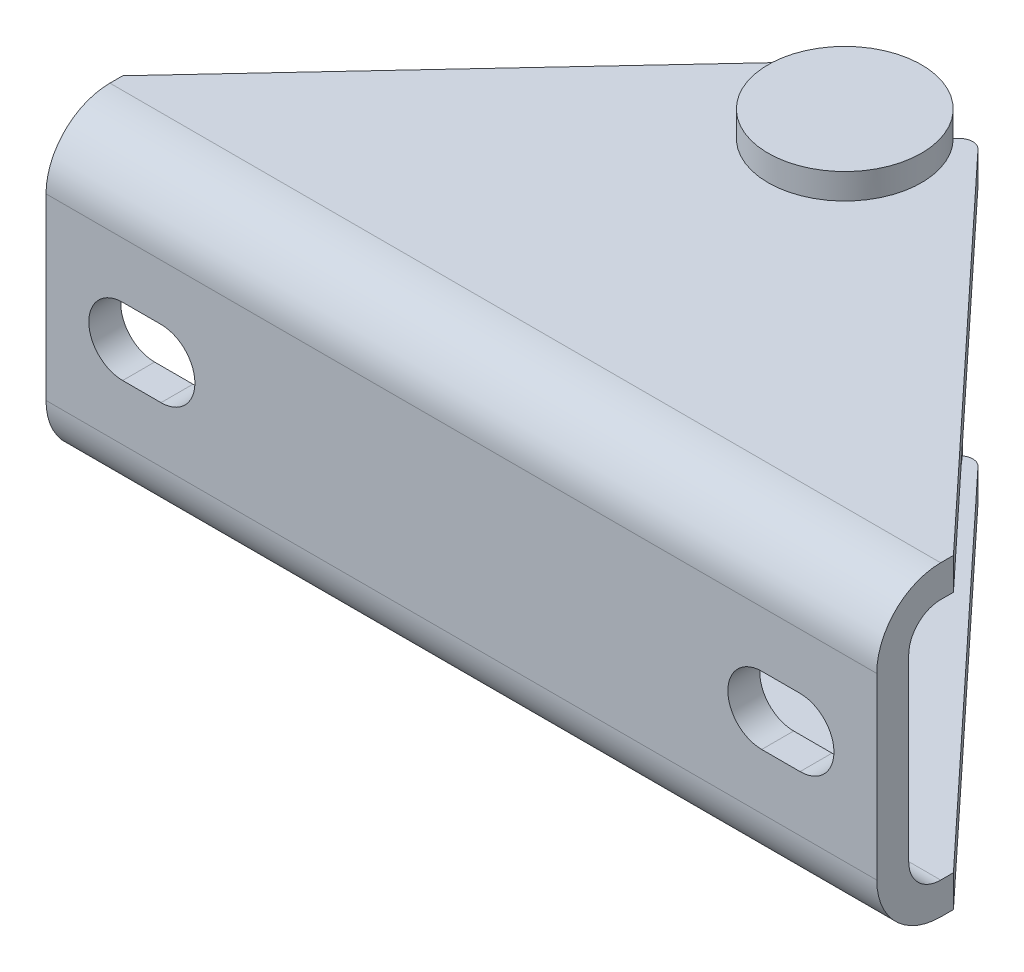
ISO-10303-21;
HEADER;
FILE_DESCRIPTION(('STEP AP214'),'2;1');
FILE_NAME('part.step','',(''),(''),'','','');
FILE_SCHEMA(('AUTOMOTIVE_DESIGN { 1 0 10303 214 1 1 1 1 }'));
ENDSEC;
DATA;
#1=APPLICATION_CONTEXT('core data for automotive mechanical design processes');
#2=APPLICATION_PROTOCOL_DEFINITION('international standard','automotive_design',2000,#1);
#3=PRODUCT_CONTEXT('',#1,'mechanical');
#4=PRODUCT('Part','Part','',(#3));
#5=PRODUCT_RELATED_PRODUCT_CATEGORY('part','',(#4));
#6=PRODUCT_DEFINITION_FORMATION('','',#4);
#7=PRODUCT_DEFINITION_CONTEXT('part definition',#1,'design');
#8=PRODUCT_DEFINITION('design','',#6,#7);
#9=PRODUCT_DEFINITION_SHAPE('','',#8);
#10=(LENGTH_UNIT() NAMED_UNIT(*) SI_UNIT(.MILLI.,.METRE.));
#11=(NAMED_UNIT(*) PLANE_ANGLE_UNIT() SI_UNIT($,.RADIAN.));
#12=(NAMED_UNIT(*) SI_UNIT($,.STERADIAN.) SOLID_ANGLE_UNIT());
#13=UNCERTAINTY_MEASURE_WITH_UNIT(LENGTH_MEASURE(1.E-05),#10,'distance_accuracy_value','');
#14=(GEOMETRIC_REPRESENTATION_CONTEXT(3) GLOBAL_UNCERTAINTY_ASSIGNED_CONTEXT((#13)) GLOBAL_UNIT_ASSIGNED_CONTEXT((#10,
#11,#12)) REPRESENTATION_CONTEXT('',''));
#15=CARTESIAN_POINT('',(0.,0.,0.));
#16=DIRECTION('',(0.,0.,1.));
#17=DIRECTION('',(1.,0.,0.));
#18=AXIS2_PLACEMENT_3D('',#15,#16,#17);
#19=CARTESIAN_POINT('',(26.5,-12.,-30.));
#20=DIRECTION('',(0.,1.,0.));
#21=DIRECTION('',(-0.924463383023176,0.,0.381270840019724));
#22=AXIS2_PLACEMENT_3D('',#19,#20,#21);
#23=PLANE('',#22);
#24=CARTESIAN_POINT('',(26.5,-12.,-30.));
#25=DIRECTION('',(0.,1.,0.));
#26=DIRECTION('',(-0.924463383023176,0.,0.381270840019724));
#27=AXIS2_PLACEMENT_3D('',#24,#25,#26);
#28=CIRCLE('',#27,5.);
#29=CARTESIAN_POINT('',(30.5,-12.,-33.));
#30=VERTEX_POINT('',#29);
#31=CARTESIAN_POINT('',(22.5,-12.,-33.));
#32=VERTEX_POINT('',#31);
#33=EDGE_CURVE('E360',#30,#32,#28,.T.);
#34=ORIENTED_EDGE('',*,*,#33,.T.);
#35=DIRECTION('',(0.,0.,1.));
#36=VECTOR('',#35,1.);
#37=CARTESIAN_POINT('',(22.5,-12.,-30.));
#38=LINE('',#37,#36);
#39=CARTESIAN_POINT('',(22.5,-12.,-30.));
#40=VERTEX_POINT('',#39);
#41=EDGE_CURVE('E468',#32,#40,#38,.T.);
#42=ORIENTED_EDGE('',*,*,#41,.T.);
#43=CARTESIAN_POINT('',(26.5,-12.,-30.));
#44=DIRECTION('',(0.,-1.,0.));
#45=DIRECTION('',(0.99999998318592,0.,0.00018337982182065));
#46=AXIS2_PLACEMENT_3D('',#43,#44,#45);
#47=CIRCLE('',#46,4.);
#48=CARTESIAN_POINT('',(30.5,-12.,-30.));
#49=VERTEX_POINT('',#48);
#50=EDGE_CURVE('E356',#40,#49,#47,.T.);
#51=ORIENTED_EDGE('',*,*,#50,.T.);
#52=DIRECTION('',(0.,0.,-1.));
#53=VECTOR('',#52,1.);
#54=CARTESIAN_POINT('',(30.5,-12.,-30.));
#55=LINE('',#54,#53);
#56=EDGE_CURVE('E473',#49,#30,#55,.T.);
#57=ORIENTED_EDGE('',*,*,#56,.T.);
#58=EDGE_LOOP('',(#34,#42,#51,#57));
#59=FACE_BOUND('',#58,.T.);
#60=ADVANCED_FACE('F15',(#59),#23,.T.);
#61=CARTESIAN_POINT('',(31.7113880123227,-12.,-33.7971744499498));
#62=DIRECTION('',(0.,1.,0.));
#63=DIRECTION('',(1.,0.,0.));
#64=AXIS2_PLACEMENT_3D('',#61,#62,#63);
#65=PLANE('',#64);
#66=CARTESIAN_POINT('',(22.5,-12.,-34.));
#67=VERTEX_POINT('',#66);
#68=EDGE_CURVE('E469',#67,#32,#38,.T.);
#69=ORIENTED_EDGE('',*,*,#68,.T.);
#70=EDGE_CURVE('E390',#32,#30,#28,.T.);
#71=ORIENTED_EDGE('',*,*,#70,.T.);
#72=CARTESIAN_POINT('',(30.5,-12.,-34.));
#73=VERTEX_POINT('',#72);
#74=EDGE_CURVE('E472',#30,#73,#55,.T.);
#75=ORIENTED_EDGE('',*,*,#74,.T.);
#76=DIRECTION('',(0.707106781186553,0.,-0.707106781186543));
#77=VECTOR('',#76,1.);
#78=CARTESIAN_POINT('',(30.5,-12.,-34.));
#79=LINE('',#78,#77);
#80=CARTESIAN_POINT('',(31.0042812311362,-12.,-34.5042812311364));
#81=VERTEX_POINT('',#80);
#82=EDGE_CURVE('E475',#73,#81,#79,.T.);
#83=ORIENTED_EDGE('',*,*,#82,.T.);
#84=CARTESIAN_POINT('',(31.7113880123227,-12.,-33.7971744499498));
#85=DIRECTION('',(0.,-1.,0.));
#86=DIRECTION('',(1.,0.,0.));
#87=AXIS2_PLACEMENT_3D('',#84,#85,#86);
#88=CIRCLE('',#87,1.);
#89=CARTESIAN_POINT('',(32.4427417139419,-12.,-34.4791728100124));
#90=VERTEX_POINT('',#89);
#91=EDGE_CURVE('E478',#81,#90,#88,.T.);
#92=ORIENTED_EDGE('',*,*,#91,.T.);
#93=DIRECTION('',(0.681998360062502,0.,0.731353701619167));
#94=VECTOR('',#93,1.);
#95=CARTESIAN_POINT('',(59.,-12.,-6.0000000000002));
#96=LINE('',#95,#94);
#97=CARTESIAN_POINT('',(59.,-12.,-6.0000000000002));
#98=VERTEX_POINT('',#97);
#99=EDGE_CURVE('E451',#90,#98,#96,.T.);
#100=ORIENTED_EDGE('',*,*,#99,.T.);
#101=DIRECTION('',(0.,0.,1.));
#102=VECTOR('',#101,1.);
#103=CARTESIAN_POINT('',(59.,-12.,-2.15105711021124E-13));
#104=LINE('',#103,#102);
#105=CARTESIAN_POINT('',(59.,-12.,-5.00000000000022));
#106=VERTEX_POINT('',#105);
#107=EDGE_CURVE('E454',#98,#106,#104,.T.);
#108=ORIENTED_EDGE('',*,*,#107,.T.);
#109=DIRECTION('',(-1.,0.,0.));
#110=VECTOR('',#109,1.);
#111=CARTESIAN_POINT('',(-6.,-12.,-5.));
#112=LINE('',#111,#110);
#113=CARTESIAN_POINT('',(-6.,-12.,-5.));
#114=VERTEX_POINT('',#113);
#115=EDGE_CURVE('E579',#106,#114,#112,.T.);
#116=ORIENTED_EDGE('',*,*,#115,.T.);
#117=DIRECTION('',(0.,0.,-1.));
#118=VECTOR('',#117,1.);
#119=CARTESIAN_POINT('',(-6.,-12.,0.));
#120=LINE('',#119,#118);
#121=CARTESIAN_POINT('',(-6.,-12.,-6.));
#122=VERTEX_POINT('',#121);
#123=EDGE_CURVE('E457',#114,#122,#120,.T.);
#124=ORIENTED_EDGE('',*,*,#123,.T.);
#125=DIRECTION('',(0.681998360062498,0.,-0.731353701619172));
#126=VECTOR('',#125,1.);
#127=CARTESIAN_POINT('',(-6.,-12.,-6.));
#128=LINE('',#127,#126);
#129=CARTESIAN_POINT('',(20.5572582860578,-12.,-34.4791728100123));
#130=VERTEX_POINT('',#129);
#131=EDGE_CURVE('E459',#122,#130,#128,.T.);
#132=ORIENTED_EDGE('',*,*,#131,.T.);
#133=CARTESIAN_POINT('',(21.2886119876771,-12.,-33.7971744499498));
#134=DIRECTION('',(0.,-1.,0.));
#135=DIRECTION('',(-1.,0.,0.));
#136=AXIS2_PLACEMENT_3D('',#133,#134,#135);
#137=CIRCLE('',#136,1.);
#138=CARTESIAN_POINT('',(21.9957187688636,-12.,-34.5042812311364));
#139=VERTEX_POINT('',#138);
#140=EDGE_CURVE('E462',#130,#139,#137,.T.);
#141=ORIENTED_EDGE('',*,*,#140,.T.);
#142=DIRECTION('',(0.707106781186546,0.,0.70710678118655));
#143=VECTOR('',#142,1.);
#144=CARTESIAN_POINT('',(22.5,-12.,-34.));
#145=LINE('',#144,#143);
#146=EDGE_CURVE('E465',#139,#67,#145,.T.);
#147=ORIENTED_EDGE('',*,*,#146,.T.);
#148=EDGE_LOOP('',(#69,#71,#75,#83,#92,#100,#108,#116,#124,#132,#141,#147));
#149=FACE_BOUND('',#148,.T.);
#150=ADVANCED_FACE('F652',(#149),#65,.F.);
#151=CARTESIAN_POINT('',(22.5,12.,-30.));
#152=DIRECTION('',(1.,0.,0.));
#153=DIRECTION('',(0.,0.,1.));
#154=AXIS2_PLACEMENT_3D('',#151,#152,#153);
#155=PLANE('',#154);
#156=DIRECTION('',(0.,0.,-1.));
#157=VECTOR('',#156,1.);
#158=CARTESIAN_POINT('',(22.5,-9.5,-30.));
#159=LINE('',#158,#157);
#160=CARTESIAN_POINT('',(22.5,-9.5,-30.));
#161=VERTEX_POINT('',#160);
#162=CARTESIAN_POINT('',(22.5,-9.5,-31.4361406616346));
#163=VERTEX_POINT('',#162);
#164=EDGE_CURVE('E437',#161,#163,#159,.T.);
#165=ORIENTED_EDGE('',*,*,#164,.F.);
#166=DIRECTION('',(0.,-1.,0.));
#167=VECTOR('',#166,1.);
#168=CARTESIAN_POINT('',(22.5,12.,-30.));
#169=LINE('',#168,#167);
#170=EDGE_CURVE('E528',#161,#40,#169,.T.);
#171=ORIENTED_EDGE('',*,*,#170,.T.);
#172=ORIENTED_EDGE('',*,*,#41,.F.);
#173=ORIENTED_EDGE('',*,*,#68,.F.);
#174=DIRECTION('',(0.,-1.,0.));
#175=VECTOR('',#174,1.);
#176=CARTESIAN_POINT('',(22.5,12.,-34.));
#177=LINE('',#176,#175);
#178=CARTESIAN_POINT('',(22.5,-9.5,-34.));
#179=VERTEX_POINT('',#178);
#180=EDGE_CURVE('E532',#179,#67,#177,.T.);
#181=ORIENTED_EDGE('',*,*,#180,.F.);
#182=EDGE_CURVE('E433',#163,#179,#159,.T.);
#183=ORIENTED_EDGE('',*,*,#182,.F.);
#184=EDGE_LOOP('',(#165,#171,#172,#173,#181,#183));
#185=FACE_BOUND('',#184,.T.);
#186=ADVANCED_FACE('F816',(#185),#155,.T.);
#187=CARTESIAN_POINT('',(26.5,-12.,-30.));
#188=DIRECTION('',(0.,1.,0.));
#189=DIRECTION('',(-0.99999998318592,0.,-0.00018337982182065));
#190=AXIS2_PLACEMENT_3D('',#187,#188,#189);
#191=CYLINDRICAL_SURFACE('',#190,4.);
#192=CARTESIAN_POINT('',(26.5,12.,-30.));
#193=DIRECTION('',(0.,-1.,0.));
#194=DIRECTION('',(0.99999998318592,0.,0.00018337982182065));
#195=AXIS2_PLACEMENT_3D('',#192,#193,#194);
#196=CIRCLE('',#195,4.);
#197=CARTESIAN_POINT('',(30.5,12.,-30.));
#198=VERTEX_POINT('',#197);
#199=CARTESIAN_POINT('',(22.5,12.,-30.));
#200=VERTEX_POINT('',#199);
#201=EDGE_CURVE('E355',#198,#200,#196,.F.);
#202=ORIENTED_EDGE('',*,*,#201,.F.);
#203=DIRECTION('',(0.,-1.,0.));
#204=VECTOR('',#203,1.);
#205=CARTESIAN_POINT('',(30.5,12.,-30.));
#206=LINE('',#205,#204);
#207=CARTESIAN_POINT('',(30.5,9.5,-30.));
#208=VERTEX_POINT('',#207);
#209=EDGE_CURVE('E523',#198,#208,#206,.T.);
#210=ORIENTED_EDGE('',*,*,#209,.T.);
#211=CARTESIAN_POINT('',(26.5,9.5,-30.));
#212=DIRECTION('',(0.,1.,0.));
#213=DIRECTION('',(1.,0.,0.));
#214=AXIS2_PLACEMENT_3D('',#211,#212,#213);
#215=CIRCLE('',#214,4.);
#216=CARTESIAN_POINT('',(22.5,9.5,-30.));
#217=VERTEX_POINT('',#216);
#218=EDGE_CURVE('E405',#217,#208,#215,.T.);
#219=ORIENTED_EDGE('',*,*,#218,.F.);
#220=EDGE_CURVE('E526',#200,#217,#169,.T.);
#221=ORIENTED_EDGE('',*,*,#220,.F.);
#222=EDGE_LOOP('',(#202,#210,#219,#221));
#223=FACE_BOUND('',#222,.T.);
#224=CARTESIAN_POINT('',(26.5,-9.5,-30.));
#225=DIRECTION('',(0.,-1.,0.));
#226=DIRECTION('',(-1.,0.,0.));
#227=AXIS2_PLACEMENT_3D('',#224,#225,#226);
#228=CIRCLE('',#227,4.);
#229=CARTESIAN_POINT('',(30.5,-9.5,-30.));
#230=VERTEX_POINT('',#229);
#231=EDGE_CURVE('E434',#230,#161,#228,.T.);
#232=ORIENTED_EDGE('',*,*,#231,.F.);
#233=EDGE_CURVE('E525',#230,#49,#206,.T.);
#234=ORIENTED_EDGE('',*,*,#233,.T.);
#235=ORIENTED_EDGE('',*,*,#50,.F.);
#236=ORIENTED_EDGE('',*,*,#170,.F.);
#237=EDGE_LOOP('',(#232,#234,#235,#236));
#238=FACE_BOUND('',#237,.T.);
#239=ADVANCED_FACE('F753',(#223,#238),#191,.T.);
#240=CARTESIAN_POINT('',(30.5,12.,-30.));
#241=DIRECTION('',(-1.,0.,0.));
#242=DIRECTION('',(0.,1.,0.));
#243=AXIS2_PLACEMENT_3D('',#240,#241,#242);
#244=PLANE('',#243);
#245=DIRECTION('',(0.,0.,1.));
#246=VECTOR('',#245,1.);
#247=CARTESIAN_POINT('',(30.5,-9.5,-30.));
#248=LINE('',#247,#246);
#249=CARTESIAN_POINT('',(30.5,-9.5,-34.));
#250=VERTEX_POINT('',#249);
#251=CARTESIAN_POINT('',(30.5,-9.5,-31.4361406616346));
#252=VERTEX_POINT('',#251);
#253=EDGE_CURVE('E431',#250,#252,#248,.T.);
#254=ORIENTED_EDGE('',*,*,#253,.F.);
#255=DIRECTION('',(0.,-1.,0.));
#256=VECTOR('',#255,1.);
#257=CARTESIAN_POINT('',(30.5,12.,-34.));
#258=LINE('',#257,#256);
#259=EDGE_CURVE('E522',#250,#73,#258,.T.);
#260=ORIENTED_EDGE('',*,*,#259,.T.);
#261=ORIENTED_EDGE('',*,*,#74,.F.);
#262=ORIENTED_EDGE('',*,*,#56,.F.);
#263=ORIENTED_EDGE('',*,*,#233,.F.);
#264=EDGE_CURVE('E428',#252,#230,#248,.T.);
#265=ORIENTED_EDGE('',*,*,#264,.F.);
#266=EDGE_LOOP('',(#254,#260,#261,#262,#263,#265));
#267=FACE_BOUND('',#266,.T.);
#268=ADVANCED_FACE('F647',(#267),#244,.T.);
#269=CARTESIAN_POINT('',(30.5,12.,-34.));
#270=DIRECTION('',(-0.707106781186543,0.,-0.707106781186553));
#271=DIRECTION('',(0.707106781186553,0.,-0.707106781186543));
#272=AXIS2_PLACEMENT_3D('',#269,#270,#271);
#273=PLANE('',#272);
#274=DIRECTION('',(-0.707106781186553,0.,0.707106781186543));
#275=VECTOR('',#274,1.);
#276=CARTESIAN_POINT('',(30.5,-9.5,-34.));
#277=LINE('',#276,#275);
#278=CARTESIAN_POINT('',(31.0042812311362,-9.5,-34.5042812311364));
#279=VERTEX_POINT('',#278);
#280=EDGE_CURVE('E31',#279,#250,#277,.T.);
#281=ORIENTED_EDGE('',*,*,#280,.F.);
#282=DIRECTION('',(0.,-1.,0.));
#283=VECTOR('',#282,1.);
#284=CARTESIAN_POINT('',(31.0042812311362,12.,-34.5042812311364));
#285=LINE('',#284,#283);
#286=EDGE_CURVE('E518',#279,#81,#285,.T.);
#287=ORIENTED_EDGE('',*,*,#286,.T.);
#288=ORIENTED_EDGE('',*,*,#82,.F.);
#289=ORIENTED_EDGE('',*,*,#259,.F.);
#290=EDGE_LOOP('',(#281,#287,#288,#289));
#291=FACE_BOUND('',#290,.T.);
#292=ADVANCED_FACE('F826',(#291),#273,.T.);
#293=CARTESIAN_POINT('',(31.7113880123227,12.,-33.7971744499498));
#294=DIRECTION('',(0.,-1.,0.));
#295=DIRECTION('',(-1.,0.,0.));
#296=AXIS2_PLACEMENT_3D('',#293,#294,#295);
#297=CYLINDRICAL_SURFACE('',#296,1.);
#298=CARTESIAN_POINT('',(31.7113880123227,-9.5,-33.7971744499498));
#299=DIRECTION('',(0.,-1.,0.));
#300=DIRECTION('',(-1.,0.,0.));
#301=AXIS2_PLACEMENT_3D('',#298,#299,#300);
#302=CIRCLE('',#301,1.);
#303=CARTESIAN_POINT('',(32.4427417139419,-9.5,-34.4791728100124));
#304=VERTEX_POINT('',#303);
#305=CARTESIAN_POINT('',(31.1021887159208,-9.5,-34.590191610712));
#306=VERTEX_POINT('',#305);
#307=EDGE_CURVE('E425',#304,#306,#302,.F.);
#308=ORIENTED_EDGE('',*,*,#307,.F.);
#309=DIRECTION('',(0.,-1.,0.));
#310=VECTOR('',#309,1.);
#311=CARTESIAN_POINT('',(32.4427417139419,12.,-34.4791728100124));
#312=LINE('',#311,#310);
#313=EDGE_CURVE('E514',#304,#90,#312,.T.);
#314=ORIENTED_EDGE('',*,*,#313,.T.);
#315=ORIENTED_EDGE('',*,*,#91,.F.);
#316=ORIENTED_EDGE('',*,*,#286,.F.);
#317=EDGE_CURVE('E429',#306,#279,#302,.F.);
#318=ORIENTED_EDGE('',*,*,#317,.F.);
#319=EDGE_LOOP('',(#308,#314,#315,#316,#318));
#320=FACE_BOUND('',#319,.T.);
#321=ADVANCED_FACE('F777',(#320),#297,.T.);
#322=CARTESIAN_POINT('',(59.,12.,-6.0000000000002));
#323=DIRECTION('',(0.731353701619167,0.,-0.681998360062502));
#324=DIRECTION('',(0.681998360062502,0.,0.731353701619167));
#325=AXIS2_PLACEMENT_3D('',#322,#323,#324);
#326=PLANE('',#325);
#327=DIRECTION('',(-0.681998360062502,0.,-0.731353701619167));
#328=VECTOR('',#327,1.);
#329=CARTESIAN_POINT('',(59.,-9.5,-6.0000000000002));
#330=LINE('',#329,#328);
#331=CARTESIAN_POINT('',(59.,-9.5,-6.0000000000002));
#332=VERTEX_POINT('',#331);
#333=EDGE_CURVE('E423',#332,#304,#330,.T.);
#334=ORIENTED_EDGE('',*,*,#333,.F.);
#335=DIRECTION('',(0.,-1.,0.));
#336=VECTOR('',#335,1.);
#337=CARTESIAN_POINT('',(59.,12.,-6.0000000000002));
#338=LINE('',#337,#336);
#339=EDGE_CURVE('E509',#332,#98,#338,.T.);
#340=ORIENTED_EDGE('',*,*,#339,.T.);
#341=ORIENTED_EDGE('',*,*,#99,.F.);
#342=ORIENTED_EDGE('',*,*,#313,.F.);
#343=EDGE_LOOP('',(#334,#340,#341,#342));
#344=FACE_BOUND('',#343,.T.);
#345=ADVANCED_FACE('F709',(#344),#326,.T.);
#346=CARTESIAN_POINT('',(59.,12.,-2.15105711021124E-13));
#347=DIRECTION('',(1.,0.,0.));
#348=DIRECTION('',(0.,-1.,0.));
#349=AXIS2_PLACEMENT_3D('',#346,#347,#348);
#350=PLANE('',#349);
#351=DIRECTION('',(0.,-1.,0.));
#352=VECTOR('',#351,1.);
#353=CARTESIAN_POINT('',(59.,12.,-2.15105711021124E-13));
#354=LINE('',#353,#352);
#355=CARTESIAN_POINT('',(59.,7.,-2.15105711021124E-13));
#356=VERTEX_POINT('',#355);
#357=CARTESIAN_POINT('',(59.,-7.,-2.15105711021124E-13));
#358=VERTEX_POINT('',#357);
#359=EDGE_CURVE('E548',#356,#358,#354,.T.);
#360=ORIENTED_EDGE('',*,*,#359,.T.);
#361=CARTESIAN_POINT('',(59.,-7.,-5.00000000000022));
#362=DIRECTION('',(1.,0.,0.));
#363=DIRECTION('',(0.,-1.,0.));
#364=AXIS2_PLACEMENT_3D('',#361,#362,#363);
#365=CIRCLE('',#364,5.);
#366=EDGE_CURVE('E593',#358,#106,#365,.T.);
#367=ORIENTED_EDGE('',*,*,#366,.T.);
#368=ORIENTED_EDGE('',*,*,#107,.F.);
#369=ORIENTED_EDGE('',*,*,#339,.F.);
#370=DIRECTION('',(0.,0.,-1.));
#371=VECTOR('',#370,1.);
#372=CARTESIAN_POINT('',(59.,-9.5,-2.15105711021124E-13));
#373=LINE('',#372,#371);
#374=CARTESIAN_POINT('',(59.,-9.5,-5.00000000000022));
#375=VERTEX_POINT('',#374);
#376=EDGE_CURVE('E559',#375,#332,#373,.T.);
#377=ORIENTED_EDGE('',*,*,#376,.F.);
#378=CARTESIAN_POINT('',(59.,-7.,-5.00000000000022));
#379=DIRECTION('',(1.,0.,0.));
#380=DIRECTION('',(0.,-1.,0.));
#381=AXIS2_PLACEMENT_3D('',#378,#379,#380);
#382=CIRCLE('',#381,2.5);
#383=CARTESIAN_POINT('',(59.,-7.,-2.50000000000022));
#384=VERTEX_POINT('',#383);
#385=EDGE_CURVE('E577',#375,#384,#382,.F.);
#386=ORIENTED_EDGE('',*,*,#385,.T.);
#387=DIRECTION('',(0.,-1.,0.));
#388=VECTOR('',#387,1.);
#389=CARTESIAN_POINT('',(59.,12.,-2.50000000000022));
#390=LINE('',#389,#388);
#391=CARTESIAN_POINT('',(59.,7.,-2.50000000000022));
#392=VERTEX_POINT('',#391);
#393=EDGE_CURVE('E513',#392,#384,#390,.T.);
#394=ORIENTED_EDGE('',*,*,#393,.F.);
#395=CARTESIAN_POINT('',(59.,7.,-5.00000000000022));
#396=DIRECTION('',(1.,0.,0.));
#397=DIRECTION('',(0.,-1.,0.));
#398=AXIS2_PLACEMENT_3D('',#395,#396,#397);
#399=CIRCLE('',#398,2.5);
#400=CARTESIAN_POINT('',(59.,9.5,-5.00000000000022));
#401=VERTEX_POINT('',#400);
#402=EDGE_CURVE('E573',#392,#401,#399,.F.);
#403=ORIENTED_EDGE('',*,*,#402,.T.);
#404=DIRECTION('',(0.,0.,1.));
#405=VECTOR('',#404,1.);
#406=CARTESIAN_POINT('',(59.,9.5,-2.15105711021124E-13));
#407=LINE('',#406,#405);
#408=CARTESIAN_POINT('',(59.,9.5,-6.0000000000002));
#409=VERTEX_POINT('',#408);
#410=EDGE_CURVE('E556',#409,#401,#407,.T.);
#411=ORIENTED_EDGE('',*,*,#410,.F.);
#412=CARTESIAN_POINT('',(59.,12.,-6.0000000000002));
#413=VERTEX_POINT('',#412);
#414=EDGE_CURVE('E551',#413,#409,#338,.T.);
#415=ORIENTED_EDGE('',*,*,#414,.F.);
#416=DIRECTION('',(0.,0.,1.));
#417=VECTOR('',#416,1.);
#418=CARTESIAN_POINT('',(59.,12.,-2.15105711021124E-13));
#419=LINE('',#418,#417);
#420=CARTESIAN_POINT('',(59.,12.,-5.00000000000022));
#421=VERTEX_POINT('',#420);
#422=EDGE_CURVE('E484',#413,#421,#419,.T.);
#423=ORIENTED_EDGE('',*,*,#422,.T.);
#424=CARTESIAN_POINT('',(59.,7.,-5.00000000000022));
#425=DIRECTION('',(1.,0.,0.));
#426=DIRECTION('',(0.,-1.,0.));
#427=AXIS2_PLACEMENT_3D('',#424,#425,#426);
#428=CIRCLE('',#427,5.);
#429=EDGE_CURVE('E591',#421,#356,#428,.T.);
#430=ORIENTED_EDGE('',*,*,#429,.T.);
#431=EDGE_LOOP('',(#360,#367,#368,#369,#377,#386,#394,#403,#411,#415,#423,#430));
#432=FACE_BOUND('',#431,.T.);
#433=ADVANCED_FACE('F695',(#432),#350,.T.);
#434=CARTESIAN_POINT('',(31.7113880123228,-7.,-5.0000000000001));
#435=DIRECTION('',(1.,0.,0.));
#436=DIRECTION('',(0.,-1.,0.));
#437=AXIS2_PLACEMENT_3D('',#434,#435,#436);
#438=CYLINDRICAL_SURFACE('',#437,5.);
#439=ORIENTED_EDGE('',*,*,#366,.F.);
#440=DIRECTION('',(-1.,0.,0.));
#441=VECTOR('',#440,1.);
#442=CARTESIAN_POINT('',(59.,-7.,-2.15105711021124E-13));
#443=LINE('',#442,#441);
#444=CARTESIAN_POINT('',(-6.,-7.,0.));
#445=VERTEX_POINT('',#444);
#446=EDGE_CURVE('E589',#445,#358,#443,.F.);
#447=ORIENTED_EDGE('',*,*,#446,.F.);
#448=CARTESIAN_POINT('',(-6.,-7.,-5.));
#449=DIRECTION('',(-1.,0.,0.));
#450=DIRECTION('',(0.,1.,0.));
#451=AXIS2_PLACEMENT_3D('',#448,#449,#450);
#452=CIRCLE('',#451,5.);
#453=EDGE_CURVE('E584',#114,#445,#452,.T.);
#454=ORIENTED_EDGE('',*,*,#453,.F.);
#455=ORIENTED_EDGE('',*,*,#115,.F.);
#456=EDGE_LOOP('',(#439,#447,#454,#455));
#457=FACE_BOUND('',#456,.T.);
#458=ADVANCED_FACE('F701',(#457),#438,.T.);
#459=CARTESIAN_POINT('',(-6.,12.,0.));
#460=DIRECTION('',(-1.,0.,0.));
#461=DIRECTION('',(0.,1.,0.));
#462=AXIS2_PLACEMENT_3D('',#459,#460,#461);
#463=PLANE('',#462);
#464=ORIENTED_EDGE('',*,*,#123,.F.);
#465=ORIENTED_EDGE('',*,*,#453,.T.);
#466=DIRECTION('',(0.,-1.,0.));
#467=VECTOR('',#466,1.);
#468=CARTESIAN_POINT('',(-6.,12.,0.));
#469=LINE('',#468,#467);
#470=CARTESIAN_POINT('',(-6.,7.,0.));
#471=VERTEX_POINT('',#470);
#472=EDGE_CURVE('E545',#471,#445,#469,.T.);
#473=ORIENTED_EDGE('',*,*,#472,.F.);
#474=CARTESIAN_POINT('',(-6.,7.,-5.));
#475=DIRECTION('',(-1.,0.,0.));
#476=DIRECTION('',(0.,1.,0.));
#477=AXIS2_PLACEMENT_3D('',#474,#475,#476);
#478=CIRCLE('',#477,5.);
#479=CARTESIAN_POINT('',(-6.,12.,-5.));
#480=VERTEX_POINT('',#479);
#481=EDGE_CURVE('E582',#471,#480,#478,.T.);
#482=ORIENTED_EDGE('',*,*,#481,.T.);
#483=DIRECTION('',(0.,0.,-1.));
#484=VECTOR('',#483,1.);
#485=CARTESIAN_POINT('',(-6.,12.,0.));
#486=LINE('',#485,#484);
#487=CARTESIAN_POINT('',(-6.,12.,-6.));
#488=VERTEX_POINT('',#487);
#489=EDGE_CURVE('E487',#480,#488,#486,.T.);
#490=ORIENTED_EDGE('',*,*,#489,.T.);
#491=DIRECTION('',(0.,-1.,0.));
#492=VECTOR('',#491,1.);
#493=CARTESIAN_POINT('',(-6.,12.,-6.));
#494=LINE('',#493,#492);
#495=CARTESIAN_POINT('',(-6.,9.5,-6.));
#496=VERTEX_POINT('',#495);
#497=EDGE_CURVE('E541',#488,#496,#494,.T.);
#498=ORIENTED_EDGE('',*,*,#497,.T.);
#499=DIRECTION('',(0.,0.,-1.));
#500=VECTOR('',#499,1.);
#501=CARTESIAN_POINT('',(-6.,9.5,0.));
#502=LINE('',#501,#500);
#503=CARTESIAN_POINT('',(-6.,9.5,-5.));
#504=VERTEX_POINT('',#503);
#505=EDGE_CURVE('E421',#504,#496,#502,.T.);
#506=ORIENTED_EDGE('',*,*,#505,.F.);
#507=CARTESIAN_POINT('',(-6.,7.,-5.));
#508=DIRECTION('',(-1.,0.,0.));
#509=DIRECTION('',(0.,1.,0.));
#510=AXIS2_PLACEMENT_3D('',#507,#508,#509);
#511=CIRCLE('',#510,2.5);
#512=CARTESIAN_POINT('',(-6.,7.,-2.49999999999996));
#513=VERTEX_POINT('',#512);
#514=EDGE_CURVE('E571',#504,#513,#511,.F.);
#515=ORIENTED_EDGE('',*,*,#514,.T.);
#516=DIRECTION('',(0.,1.,0.));
#517=VECTOR('',#516,1.);
#518=CARTESIAN_POINT('',(-6.,12.,-2.49999999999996));
#519=LINE('',#518,#517);
#520=CARTESIAN_POINT('',(-6.,-7.,-2.49999999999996));
#521=VERTEX_POINT('',#520);
#522=EDGE_CURVE('E359',#521,#513,#519,.T.);
#523=ORIENTED_EDGE('',*,*,#522,.F.);
#524=CARTESIAN_POINT('',(-6.,-7.,-5.));
#525=DIRECTION('',(-1.,0.,0.));
#526=DIRECTION('',(0.,1.,0.));
#527=AXIS2_PLACEMENT_3D('',#524,#525,#526);
#528=CIRCLE('',#527,2.5);
#529=CARTESIAN_POINT('',(-6.,-9.5,-5.));
#530=VERTEX_POINT('',#529);
#531=EDGE_CURVE('E575',#521,#530,#528,.F.);
#532=ORIENTED_EDGE('',*,*,#531,.T.);
#533=DIRECTION('',(0.,0.,1.));
#534=VECTOR('',#533,1.);
#535=CARTESIAN_POINT('',(-6.,-9.5,0.));
#536=LINE('',#535,#534);
#537=CARTESIAN_POINT('',(-6.,-9.5,-6.));
#538=VERTEX_POINT('',#537);
#539=EDGE_CURVE('E448',#538,#530,#536,.T.);
#540=ORIENTED_EDGE('',*,*,#539,.F.);
#541=EDGE_CURVE('E544',#538,#122,#494,.T.);
#542=ORIENTED_EDGE('',*,*,#541,.T.);
#543=EDGE_LOOP('',(#464,#465,#473,#482,#490,#498,#506,#515,#523,#532,#540,#542));
#544=FACE_BOUND('',#543,.T.);
#545=ADVANCED_FACE('F685',(#544),#463,.T.);
#546=CARTESIAN_POINT('',(-6.,12.,-6.));
#547=DIRECTION('',(-0.731353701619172,0.,-0.681998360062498));
#548=DIRECTION('',(0.681998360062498,0.,-0.731353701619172));
#549=AXIS2_PLACEMENT_3D('',#546,#547,#548);
#550=PLANE('',#549);
#551=DIRECTION('',(-0.681998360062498,0.,0.731353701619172));
#552=VECTOR('',#551,1.);
#553=CARTESIAN_POINT('',(-6.,-9.5,-6.));
#554=LINE('',#553,#552);
#555=CARTESIAN_POINT('',(20.5572582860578,-9.5,-34.4791728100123));
#556=VERTEX_POINT('',#555);
#557=EDGE_CURVE('E446',#556,#538,#554,.T.);
#558=ORIENTED_EDGE('',*,*,#557,.F.);
#559=DIRECTION('',(0.,-1.,0.));
#560=VECTOR('',#559,1.);
#561=CARTESIAN_POINT('',(20.5572582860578,12.,-34.4791728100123));
#562=LINE('',#561,#560);
#563=EDGE_CURVE('E540',#556,#130,#562,.T.);
#564=ORIENTED_EDGE('',*,*,#563,.T.);
#565=ORIENTED_EDGE('',*,*,#131,.F.);
#566=ORIENTED_EDGE('',*,*,#541,.F.);
#567=EDGE_LOOP('',(#558,#564,#565,#566));
#568=FACE_BOUND('',#567,.T.);
#569=ADVANCED_FACE('F859',(#568),#550,.T.);
#570=CARTESIAN_POINT('',(21.2886119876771,12.,-33.7971744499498));
#571=DIRECTION('',(0.,-1.,0.));
#572=DIRECTION('',(-1.,0.,0.));
#573=AXIS2_PLACEMENT_3D('',#570,#571,#572);
#574=CYLINDRICAL_SURFACE('',#573,1.);
#575=CARTESIAN_POINT('',(21.2886119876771,-9.5,-33.7971744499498));
#576=DIRECTION('',(0.,-1.,0.));
#577=DIRECTION('',(-1.,0.,0.));
#578=AXIS2_PLACEMENT_3D('',#575,#576,#577);
#579=CIRCLE('',#578,1.);
#580=CARTESIAN_POINT('',(21.9957187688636,-9.5,-34.5042812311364));
#581=VERTEX_POINT('',#580);
#582=CARTESIAN_POINT('',(21.8978112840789,-9.5,-34.590191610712));
#583=VERTEX_POINT('',#582);
#584=EDGE_CURVE('E443',#581,#583,#579,.F.);
#585=ORIENTED_EDGE('',*,*,#584,.F.);
#586=DIRECTION('',(0.,-1.,0.));
#587=VECTOR('',#586,1.);
#588=CARTESIAN_POINT('',(21.9957187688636,12.,-34.5042812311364));
#589=LINE('',#588,#587);
#590=EDGE_CURVE('E536',#581,#139,#589,.T.);
#591=ORIENTED_EDGE('',*,*,#590,.T.);
#592=ORIENTED_EDGE('',*,*,#140,.F.);
#593=ORIENTED_EDGE('',*,*,#563,.F.);
#594=EDGE_CURVE('E440',#583,#556,#579,.F.);
#595=ORIENTED_EDGE('',*,*,#594,.F.);
#596=EDGE_LOOP('',(#585,#591,#592,#593,#595));
#597=FACE_BOUND('',#596,.T.);
#598=ADVANCED_FACE('F871',(#597),#574,.T.);
#599=CARTESIAN_POINT('',(22.5,12.,-34.));
#600=DIRECTION('',(0.70710678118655,0.,-0.707106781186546));
#601=DIRECTION('',(0.707106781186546,0.,0.70710678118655));
#602=AXIS2_PLACEMENT_3D('',#599,#600,#601);
#603=PLANE('',#602);
#604=DIRECTION('',(-0.707106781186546,0.,-0.70710678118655));
#605=VECTOR('',#604,1.);
#606=CARTESIAN_POINT('',(22.5,-9.5,-34.));
#607=LINE('',#606,#605);
#608=EDGE_CURVE('E441',#179,#581,#607,.T.);
#609=ORIENTED_EDGE('',*,*,#608,.F.);
#610=ORIENTED_EDGE('',*,*,#180,.T.);
#611=ORIENTED_EDGE('',*,*,#146,.F.);
#612=ORIENTED_EDGE('',*,*,#590,.F.);
#613=EDGE_LOOP('',(#609,#610,#611,#612));
#614=FACE_BOUND('',#613,.T.);
#615=ADVANCED_FACE('F795',(#614),#603,.T.);
#616=CARTESIAN_POINT('',(66.5,-9.5,-37.5));
#617=DIRECTION('',(0.,-1.,0.));
#618=DIRECTION('',(-1.,0.,0.));
#619=AXIS2_PLACEMENT_3D('',#616,#617,#618);
#620=PLANE('',#619);
#621=CARTESIAN_POINT('',(26.5,-9.5,-30.));
#622=DIRECTION('',(0.,-1.,0.));
#623=DIRECTION('',(0.963329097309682,0.,0.268322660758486));
#624=AXIS2_PLACEMENT_3D('',#621,#622,#623);
#625=CIRCLE('',#624,4.25);
#626=EDGE_CURVE('E605',#252,#163,#625,.T.);
#627=ORIENTED_EDGE('',*,*,#626,.F.);
#628=ORIENTED_EDGE('',*,*,#264,.T.);
#629=ORIENTED_EDGE('',*,*,#231,.T.);
#630=ORIENTED_EDGE('',*,*,#164,.T.);
#631=EDGE_LOOP('',(#627,#628,#629,#630));
#632=FACE_BOUND('',#631,.T.);
#633=ADVANCED_FACE('F818',(#632),#620,.F.);
#634=CARTESIAN_POINT('',(26.5,-9.5,-30.));
#635=DIRECTION('',(0.,-1.,0.));
#636=DIRECTION('',(0.963329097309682,0.,0.268322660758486));
#637=AXIS2_PLACEMENT_3D('',#634,#635,#636);
#638=PLANE('',#637);
#639=CARTESIAN_POINT('',(26.5,-9.5,-30.));
#640=DIRECTION('',(0.,-1.,0.));
#641=DIRECTION('',(0.963329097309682,0.,0.268322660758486));
#642=AXIS2_PLACEMENT_3D('',#639,#640,#641);
#643=CIRCLE('',#642,6.5);
#644=EDGE_CURVE('E445',#583,#306,#643,.T.);
#645=ORIENTED_EDGE('',*,*,#644,.T.);
#646=ORIENTED_EDGE('',*,*,#317,.T.);
#647=ORIENTED_EDGE('',*,*,#280,.T.);
#648=ORIENTED_EDGE('',*,*,#253,.T.);
#649=EDGE_CURVE('E606',#163,#252,#625,.T.);
#650=ORIENTED_EDGE('',*,*,#649,.F.);
#651=ORIENTED_EDGE('',*,*,#182,.T.);
#652=ORIENTED_EDGE('',*,*,#608,.T.);
#653=ORIENTED_EDGE('',*,*,#584,.T.);
#654=EDGE_LOOP('',(#645,#646,#647,#648,#650,#651,#652,#653));
#655=FACE_BOUND('',#654,.T.);
#656=ADVANCED_FACE('F807',(#655),#638,.T.);
#657=CARTESIAN_POINT('',(26.5,12.,-30.));
#658=DIRECTION('',(0.,-1.,0.));
#659=DIRECTION('',(0.99999998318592,0.,0.00018337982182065));
#660=AXIS2_PLACEMENT_3D('',#657,#658,#659);
#661=PLANE('',#660);
#662=DIRECTION('',(0.707106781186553,0.,-0.707106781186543));
#663=VECTOR('',#662,1.);
#664=CARTESIAN_POINT('',(30.5,12.,-34.));
#665=LINE('',#664,#663);
#666=CARTESIAN_POINT('',(30.5,12.,-34.));
#667=VERTEX_POINT('',#666);
#668=CARTESIAN_POINT('',(30.7426406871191,12.,-34.2426406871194));
#669=VERTEX_POINT('',#668);
#670=EDGE_CURVE('E504',#667,#669,#665,.T.);
#671=ORIENTED_EDGE('',*,*,#670,.F.);
#672=DIRECTION('',(0.,0.,-1.));
#673=VECTOR('',#672,1.);
#674=CARTESIAN_POINT('',(30.5,12.,-30.));
#675=LINE('',#674,#673);
#676=EDGE_CURVE('E501',#198,#667,#675,.T.);
#677=ORIENTED_EDGE('',*,*,#676,.F.);
#678=ORIENTED_EDGE('',*,*,#201,.T.);
#679=DIRECTION('',(0.,0.,1.));
#680=VECTOR('',#679,1.);
#681=CARTESIAN_POINT('',(22.5,12.,-30.));
#682=LINE('',#681,#680);
#683=CARTESIAN_POINT('',(22.5,12.,-34.));
#684=VERTEX_POINT('',#683);
#685=EDGE_CURVE('E499',#684,#200,#682,.T.);
#686=ORIENTED_EDGE('',*,*,#685,.F.);
#687=DIRECTION('',(0.707106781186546,0.,0.70710678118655));
#688=VECTOR('',#687,1.);
#689=CARTESIAN_POINT('',(22.5,12.,-34.));
#690=LINE('',#689,#688);
#691=CARTESIAN_POINT('',(22.2573593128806,12.,-34.2426406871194));
#692=VERTEX_POINT('',#691);
#693=EDGE_CURVE('E495',#692,#684,#690,.T.);
#694=ORIENTED_EDGE('',*,*,#693,.F.);
#695=CARTESIAN_POINT('',(26.5,12.,-30.));
#696=DIRECTION('',(0.,-1.,0.));
#697=DIRECTION('',(0.99999998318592,0.,0.00018337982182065));
#698=AXIS2_PLACEMENT_3D('',#695,#696,#697);
#699=CIRCLE('',#698,6.);
#700=EDGE_CURVE('E366',#692,#669,#699,.T.);
#701=ORIENTED_EDGE('',*,*,#700,.T.);
#702=EDGE_LOOP('',(#671,#677,#678,#686,#694,#701));
#703=FACE_BOUND('',#702,.T.);
#704=ADVANCED_FACE('F744',(#703),#661,.T.);
#705=DIRECTION('',(0.,0.,-1.));
#706=VECTOR('',#705,1.);
#707=CARTESIAN_POINT('',(30.5,9.5,-30.));
#708=LINE('',#707,#706);
#709=CARTESIAN_POINT('',(30.5,9.5,-31.4361406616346));
#710=VERTEX_POINT('',#709);
#711=EDGE_CURVE('E402',#208,#710,#708,.T.);
#712=ORIENTED_EDGE('',*,*,#711,.F.);
#713=ORIENTED_EDGE('',*,*,#209,.F.);
#714=ORIENTED_EDGE('',*,*,#676,.T.);
#715=CARTESIAN_POINT('',(30.5,9.5,-34.));
#716=VERTEX_POINT('',#715);
#717=EDGE_CURVE('E519',#667,#716,#258,.T.);
#718=ORIENTED_EDGE('',*,*,#717,.T.);
#719=EDGE_CURVE('E401',#710,#716,#708,.T.);
#720=ORIENTED_EDGE('',*,*,#719,.F.);
#721=EDGE_LOOP('',(#712,#713,#714,#718,#720));
#722=FACE_BOUND('',#721,.T.);
#723=ADVANCED_FACE('F749',(#722),#244,.T.);
#724=CARTESIAN_POINT('',(66.5,9.5,-37.5));
#725=DIRECTION('',(0.,1.,0.));
#726=DIRECTION('',(1.,0.,0.));
#727=AXIS2_PLACEMENT_3D('',#724,#725,#726);
#728=PLANE('',#727);
#729=ORIENTED_EDGE('',*,*,#711,.T.);
#730=CARTESIAN_POINT('',(26.5,9.5,-30.));
#731=DIRECTION('',(0.,1.,0.));
#732=DIRECTION('',(-0.99999998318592,0.,-0.00018337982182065));
#733=AXIS2_PLACEMENT_3D('',#730,#731,#732);
#734=CIRCLE('',#733,4.25);
#735=CARTESIAN_POINT('',(22.5,9.5,-31.4361406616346));
#736=VERTEX_POINT('',#735);
#737=EDGE_CURVE('E597',#710,#736,#734,.F.);
#738=ORIENTED_EDGE('',*,*,#737,.T.);
#739=DIRECTION('',(0.,0.,1.));
#740=VECTOR('',#739,1.);
#741=CARTESIAN_POINT('',(22.5,9.5,-30.));
#742=LINE('',#741,#740);
#743=EDGE_CURVE('E408',#736,#217,#742,.T.);
#744=ORIENTED_EDGE('',*,*,#743,.T.);
#745=ORIENTED_EDGE('',*,*,#218,.T.);
#746=EDGE_LOOP('',(#729,#738,#744,#745));
#747=FACE_BOUND('',#746,.T.);
#748=ADVANCED_FACE('F837',(#747),#728,.F.);
#749=CARTESIAN_POINT('',(22.5,9.5,-34.));
#750=VERTEX_POINT('',#749);
#751=EDGE_CURVE('E409',#750,#736,#742,.T.);
#752=ORIENTED_EDGE('',*,*,#751,.F.);
#753=EDGE_CURVE('E529',#684,#750,#177,.T.);
#754=ORIENTED_EDGE('',*,*,#753,.F.);
#755=ORIENTED_EDGE('',*,*,#685,.T.);
#756=ORIENTED_EDGE('',*,*,#220,.T.);
#757=ORIENTED_EDGE('',*,*,#743,.F.);
#758=EDGE_LOOP('',(#752,#754,#755,#756,#757));
#759=FACE_BOUND('',#758,.T.);
#760=ADVANCED_FACE('F758',(#759),#155,.T.);
#761=ORIENTED_EDGE('',*,*,#307,.T.);
#762=EDGE_CURVE('E612',#306,#583,#643,.T.);
#763=ORIENTED_EDGE('',*,*,#762,.T.);
#764=ORIENTED_EDGE('',*,*,#594,.T.);
#765=ORIENTED_EDGE('',*,*,#557,.T.);
#766=ORIENTED_EDGE('',*,*,#539,.T.);
#767=DIRECTION('',(-1.,0.,0.));
#768=VECTOR('',#767,1.);
#769=CARTESIAN_POINT('',(59.,-9.5,-5.00000000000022));
#770=LINE('',#769,#768);
#771=EDGE_CURVE('E569',#530,#375,#770,.F.);
#772=ORIENTED_EDGE('',*,*,#771,.T.);
#773=ORIENTED_EDGE('',*,*,#376,.T.);
#774=ORIENTED_EDGE('',*,*,#333,.T.);
#775=EDGE_LOOP('',(#761,#763,#764,#765,#766,#772,#773,#774));
#776=FACE_BOUND('',#775,.T.);
#777=ADVANCED_FACE('F846',(#776),#620,.F.);
#778=CARTESIAN_POINT('',(59.,12.,-2.15105711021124E-13));
#779=DIRECTION('',(0.,0.,1.));
#780=DIRECTION('',(0.,1.,0.));
#781=AXIS2_PLACEMENT_3D('',#778,#779,#780);
#782=PLANE('',#781);
#783=ORIENTED_EDGE('',*,*,#472,.T.);
#784=ORIENTED_EDGE('',*,*,#446,.T.);
#785=ORIENTED_EDGE('',*,*,#359,.F.);
#786=DIRECTION('',(-1.,0.,0.));
#787=VECTOR('',#786,1.);
#788=CARTESIAN_POINT('',(59.,7.,-2.15105711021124E-13));
#789=LINE('',#788,#787);
#790=EDGE_CURVE('E586',#356,#471,#789,.T.);
#791=ORIENTED_EDGE('',*,*,#790,.T.);
#792=EDGE_LOOP('',(#783,#784,#785,#791));
#793=FACE_BOUND('',#792,.T.);
#794=CARTESIAN_POINT('',(0.,0.,0.));
#795=DIRECTION('',(0.,0.,1.));
#796=DIRECTION('',(1.,0.,0.));
#797=AXIS2_PLACEMENT_3D('',#794,#795,#796);
#798=CIRCLE('',#797,2.65);
#799=CARTESIAN_POINT('',(0.,2.65,0.));
#800=VERTEX_POINT('',#799);
#801=CARTESIAN_POINT('',(0.,-2.65,0.));
#802=VERTEX_POINT('',#801);
#803=EDGE_CURVE('E331',#800,#802,#798,.T.);
#804=ORIENTED_EDGE('',*,*,#803,.F.);
#805=DIRECTION('',(-1.,0.,0.));
#806=VECTOR('',#805,1.);
#807=CARTESIAN_POINT('',(0.,2.65,0.));
#808=LINE('',#807,#806);
#809=CARTESIAN_POINT('',(3.,2.65,0.));
#810=VERTEX_POINT('',#809);
#811=EDGE_CURVE('E340',#810,#800,#808,.T.);
#812=ORIENTED_EDGE('',*,*,#811,.F.);
#813=CARTESIAN_POINT('',(3.,0.,0.));
#814=DIRECTION('',(0.,0.,1.));
#815=DIRECTION('',(1.,0.,0.));
#816=AXIS2_PLACEMENT_3D('',#813,#814,#815);
#817=CIRCLE('',#816,2.65);
#818=CARTESIAN_POINT('',(3.,-2.65,0.));
#819=VERTEX_POINT('',#818);
#820=EDGE_CURVE('E337',#819,#810,#817,.T.);
#821=ORIENTED_EDGE('',*,*,#820,.F.);
#822=DIRECTION('',(1.,0.,0.));
#823=VECTOR('',#822,1.);
#824=CARTESIAN_POINT('',(0.,-2.65,0.));
#825=LINE('',#824,#823);
#826=EDGE_CURVE('E334',#802,#819,#825,.T.);
#827=ORIENTED_EDGE('',*,*,#826,.F.);
#828=EDGE_LOOP('',(#804,#812,#821,#827));
#829=FACE_BOUND('',#828,.T.);
#830=CARTESIAN_POINT('',(50.,0.,0.));
#831=DIRECTION('',(0.,0.,1.));
#832=DIRECTION('',(1.,0.,0.));
#833=AXIS2_PLACEMENT_3D('',#830,#831,#832);
#834=CIRCLE('',#833,2.65);
#835=CARTESIAN_POINT('',(50.,2.65,0.));
#836=VERTEX_POINT('',#835);
#837=CARTESIAN_POINT('',(50.,-2.65,0.));
#838=VERTEX_POINT('',#837);
#839=EDGE_CURVE('E304',#836,#838,#834,.T.);
#840=ORIENTED_EDGE('',*,*,#839,.F.);
#841=DIRECTION('',(-1.,0.,0.));
#842=VECTOR('',#841,1.);
#843=CARTESIAN_POINT('',(50.,2.65,0.));
#844=LINE('',#843,#842);
#845=CARTESIAN_POINT('',(53.,2.65,0.));
#846=VERTEX_POINT('',#845);
#847=EDGE_CURVE('E308',#846,#836,#844,.T.);
#848=ORIENTED_EDGE('',*,*,#847,.F.);
#849=CARTESIAN_POINT('',(53.,0.,0.));
#850=DIRECTION('',(0.,0.,1.));
#851=DIRECTION('',(1.,0.,0.));
#852=AXIS2_PLACEMENT_3D('',#849,#850,#851);
#853=CIRCLE('',#852,2.65);
#854=CARTESIAN_POINT('',(53.,-2.65,0.));
#855=VERTEX_POINT('',#854);
#856=EDGE_CURVE('E289',#855,#846,#853,.T.);
#857=ORIENTED_EDGE('',*,*,#856,.F.);
#858=DIRECTION('',(1.,0.,0.));
#859=VECTOR('',#858,1.);
#860=CARTESIAN_POINT('',(53.,-2.65,0.));
#861=LINE('',#860,#859);
#862=EDGE_CURVE('E298',#838,#855,#861,.T.);
#863=ORIENTED_EDGE('',*,*,#862,.F.);
#864=EDGE_LOOP('',(#840,#848,#857,#863));
#865=FACE_BOUND('',#864,.T.);
#866=ADVANCED_FACE('F306',(#793,#829,#865),#782,.T.);
#867=CARTESIAN_POINT('',(66.5,-7.,-5.00000000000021));
#868=DIRECTION('',(1.,0.,0.));
#869=DIRECTION('',(0.,-1.,0.));
#870=AXIS2_PLACEMENT_3D('',#867,#868,#869);
#871=CYLINDRICAL_SURFACE('',#870,2.5);
#872=ORIENTED_EDGE('',*,*,#385,.F.);
#873=ORIENTED_EDGE('',*,*,#771,.F.);
#874=ORIENTED_EDGE('',*,*,#531,.F.);
#875=DIRECTION('',(-1.,0.,0.));
#876=VECTOR('',#875,1.);
#877=CARTESIAN_POINT('',(-6.,-7.,-2.49999999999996));
#878=LINE('',#877,#876);
#879=EDGE_CURVE('E564',#384,#521,#878,.T.);
#880=ORIENTED_EDGE('',*,*,#879,.F.);
#881=EDGE_LOOP('',(#872,#873,#874,#880));
#882=FACE_BOUND('',#881,.T.);
#883=ADVANCED_FACE('F717',(#882),#871,.F.);
#884=CARTESIAN_POINT('',(66.5,-9.5,-2.50000000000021));
#885=DIRECTION('',(0.,0.,1.));
#886=DIRECTION('',(0.,1.,0.));
#887=AXIS2_PLACEMENT_3D('',#884,#885,#886);
#888=PLANE('',#887);
#889=ORIENTED_EDGE('',*,*,#522,.T.);
#890=DIRECTION('',(-1.,0.,0.));
#891=VECTOR('',#890,1.);
#892=CARTESIAN_POINT('',(59.,7.,-2.50000000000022));
#893=LINE('',#892,#891);
#894=EDGE_CURVE('E567',#513,#392,#893,.F.);
#895=ORIENTED_EDGE('',*,*,#894,.T.);
#896=ORIENTED_EDGE('',*,*,#393,.T.);
#897=ORIENTED_EDGE('',*,*,#879,.T.);
#898=EDGE_LOOP('',(#889,#895,#896,#897));
#899=FACE_BOUND('',#898,.T.);
#900=DIRECTION('',(-1.,0.,0.));
#901=VECTOR('',#900,1.);
#902=CARTESIAN_POINT('',(0.,-2.65,-2.49999999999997));
#903=LINE('',#902,#901);
#904=CARTESIAN_POINT('',(3.,-2.65,-2.5));
#905=VERTEX_POINT('',#904);
#906=CARTESIAN_POINT('',(0.,-2.65,-2.49999999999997));
#907=VERTEX_POINT('',#906);
#908=EDGE_CURVE('E330',#905,#907,#903,.T.);
#909=ORIENTED_EDGE('',*,*,#908,.F.);
#910=CARTESIAN_POINT('',(3.,0.,-2.5));
#911=DIRECTION('',(0.,0.,1.));
#912=DIRECTION('',(1.,0.,0.));
#913=AXIS2_PLACEMENT_3D('',#910,#911,#912);
#914=CIRCLE('',#913,2.65);
#915=CARTESIAN_POINT('',(3.,2.65,-2.5));
#916=VERTEX_POINT('',#915);
#917=EDGE_CURVE('E320',#916,#905,#914,.F.);
#918=ORIENTED_EDGE('',*,*,#917,.F.);
#919=DIRECTION('',(1.,0.,0.));
#920=VECTOR('',#919,1.);
#921=CARTESIAN_POINT('',(0.,2.65,-2.49999999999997));
#922=LINE('',#921,#920);
#923=CARTESIAN_POINT('',(0.,2.65,-2.49999999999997));
#924=VERTEX_POINT('',#923);
#925=EDGE_CURVE('E324',#924,#916,#922,.T.);
#926=ORIENTED_EDGE('',*,*,#925,.F.);
#927=CARTESIAN_POINT('',(0.,0.,-2.49999999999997));
#928=DIRECTION('',(0.,0.,1.));
#929=DIRECTION('',(1.,0.,0.));
#930=AXIS2_PLACEMENT_3D('',#927,#928,#929);
#931=CIRCLE('',#930,2.65);
#932=EDGE_CURVE('E327',#907,#924,#931,.F.);
#933=ORIENTED_EDGE('',*,*,#932,.F.);
#934=EDGE_LOOP('',(#909,#918,#926,#933));
#935=FACE_BOUND('',#934,.T.);
#936=DIRECTION('',(-1.,0.,0.));
#937=VECTOR('',#936,1.);
#938=CARTESIAN_POINT('',(53.,-2.65,-2.50000000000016));
#939=LINE('',#938,#937);
#940=CARTESIAN_POINT('',(53.,-2.65,-2.50000000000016));
#941=VERTEX_POINT('',#940);
#942=CARTESIAN_POINT('',(50.,-2.65,-2.50000000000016));
#943=VERTEX_POINT('',#942);
#944=EDGE_CURVE('E315',#941,#943,#939,.T.);
#945=ORIENTED_EDGE('',*,*,#944,.F.);
#946=CARTESIAN_POINT('',(53.,0.,-2.50000000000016));
#947=DIRECTION('',(0.,0.,1.));
#948=DIRECTION('',(1.,0.,0.));
#949=AXIS2_PLACEMENT_3D('',#946,#947,#948);
#950=CIRCLE('',#949,2.65);
#951=CARTESIAN_POINT('',(53.,2.65,-2.50000000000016));
#952=VERTEX_POINT('',#951);
#953=EDGE_CURVE('E291',#952,#941,#950,.F.);
#954=ORIENTED_EDGE('',*,*,#953,.F.);
#955=DIRECTION('',(1.,0.,0.));
#956=VECTOR('',#955,1.);
#957=CARTESIAN_POINT('',(50.,2.65,-2.50000000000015));
#958=LINE('',#957,#956);
#959=CARTESIAN_POINT('',(50.,2.65,-2.50000000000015));
#960=VERTEX_POINT('',#959);
#961=EDGE_CURVE('E1313',#960,#952,#958,.T.);
#962=ORIENTED_EDGE('',*,*,#961,.F.);
#963=CARTESIAN_POINT('',(50.,0.,-2.50000000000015));
#964=DIRECTION('',(0.,0.,1.));
#965=DIRECTION('',(1.,0.,0.));
#966=AXIS2_PLACEMENT_3D('',#963,#964,#965);
#967=CIRCLE('',#966,2.65);
#968=EDGE_CURVE('E319',#943,#960,#967,.F.);
#969=ORIENTED_EDGE('',*,*,#968,.F.);
#970=EDGE_LOOP('',(#945,#954,#962,#969));
#971=FACE_BOUND('',#970,.T.);
#972=ADVANCED_FACE('F720',(#899,#935,#971),#888,.F.);
#973=CARTESIAN_POINT('',(66.5,7.,-5.00000000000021));
#974=DIRECTION('',(1.,0.,0.));
#975=DIRECTION('',(0.,-1.,0.));
#976=AXIS2_PLACEMENT_3D('',#973,#974,#975);
#977=CYLINDRICAL_SURFACE('',#976,2.5);
#978=ORIENTED_EDGE('',*,*,#402,.F.);
#979=ORIENTED_EDGE('',*,*,#894,.F.);
#980=ORIENTED_EDGE('',*,*,#514,.F.);
#981=DIRECTION('',(-1.,0.,0.));
#982=VECTOR('',#981,1.);
#983=CARTESIAN_POINT('',(-6.,9.5,-5.));
#984=LINE('',#983,#982);
#985=EDGE_CURVE('E561',#401,#504,#984,.T.);
#986=ORIENTED_EDGE('',*,*,#985,.F.);
#987=EDGE_LOOP('',(#978,#979,#980,#986));
#988=FACE_BOUND('',#987,.T.);
#989=ADVANCED_FACE('F727',(#988),#977,.F.);
#990=CARTESIAN_POINT('',(26.5,9.5,-30.));
#991=DIRECTION('',(0.,1.,0.));
#992=DIRECTION('',(-0.99999998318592,0.,-0.00018337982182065));
#993=AXIS2_PLACEMENT_3D('',#990,#991,#992);
#994=CIRCLE('',#993,6.5);
#995=CARTESIAN_POINT('',(31.1021887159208,9.5,-34.590191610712));
#996=VERTEX_POINT('',#995);
#997=CARTESIAN_POINT('',(21.897811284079,9.5,-34.590191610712));
#998=VERTEX_POINT('',#997);
#999=EDGE_CURVE('E599',#996,#998,#994,.F.);
#1000=ORIENTED_EDGE('',*,*,#999,.F.);
#1001=CARTESIAN_POINT('',(31.7113880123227,9.5,-33.7971744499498));
#1002=DIRECTION('',(0.,1.,0.));
#1003=DIRECTION('',(1.,0.,0.));
#1004=AXIS2_PLACEMENT_3D('',#1001,#1002,#1003);
#1005=CIRCLE('',#1004,1.);
#1006=CARTESIAN_POINT('',(32.4427417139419,9.5,-34.4791728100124));
#1007=VERTEX_POINT('',#1006);
#1008=EDGE_CURVE('E395',#996,#1007,#1005,.F.);
#1009=ORIENTED_EDGE('',*,*,#1008,.T.);
#1010=DIRECTION('',(0.681998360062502,0.,0.731353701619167));
#1011=VECTOR('',#1010,1.);
#1012=CARTESIAN_POINT('',(59.,9.5,-6.0000000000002));
#1013=LINE('',#1012,#1011);
#1014=EDGE_CURVE('E393',#1007,#409,#1013,.T.);
#1015=ORIENTED_EDGE('',*,*,#1014,.T.);
#1016=ORIENTED_EDGE('',*,*,#410,.T.);
#1017=ORIENTED_EDGE('',*,*,#985,.T.);
#1018=ORIENTED_EDGE('',*,*,#505,.T.);
#1019=DIRECTION('',(0.681998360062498,0.,-0.731353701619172));
#1020=VECTOR('',#1019,1.);
#1021=CARTESIAN_POINT('',(-6.,9.5,-6.));
#1022=LINE('',#1021,#1020);
#1023=CARTESIAN_POINT('',(20.5572582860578,9.5,-34.4791728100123));
#1024=VERTEX_POINT('',#1023);
#1025=EDGE_CURVE('E419',#496,#1024,#1022,.T.);
#1026=ORIENTED_EDGE('',*,*,#1025,.T.);
#1027=CARTESIAN_POINT('',(21.2886119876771,9.5,-33.7971744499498));
#1028=DIRECTION('',(0.,1.,0.));
#1029=DIRECTION('',(1.,0.,0.));
#1030=AXIS2_PLACEMENT_3D('',#1027,#1028,#1029);
#1031=CIRCLE('',#1030,1.);
#1032=EDGE_CURVE('E416',#1024,#998,#1031,.F.);
#1033=ORIENTED_EDGE('',*,*,#1032,.T.);
#1034=EDGE_LOOP('',(#1000,#1009,#1015,#1016,#1017,#1018,#1026,#1033));
#1035=FACE_BOUND('',#1034,.T.);
#1036=ADVANCED_FACE('F729',(#1035),#728,.F.);
#1037=ORIENTED_EDGE('',*,*,#1014,.F.);
#1038=CARTESIAN_POINT('',(32.4427417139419,12.,-34.4791728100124));
#1039=VERTEX_POINT('',#1038);
#1040=EDGE_CURVE('E510',#1039,#1007,#312,.T.);
#1041=ORIENTED_EDGE('',*,*,#1040,.F.);
#1042=DIRECTION('',(0.681998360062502,0.,0.731353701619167));
#1043=VECTOR('',#1042,1.);
#1044=CARTESIAN_POINT('',(59.,12.,-6.0000000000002));
#1045=LINE('',#1044,#1043);
#1046=EDGE_CURVE('E481',#1039,#413,#1045,.T.);
#1047=ORIENTED_EDGE('',*,*,#1046,.T.);
#1048=ORIENTED_EDGE('',*,*,#414,.T.);
#1049=EDGE_LOOP('',(#1037,#1041,#1047,#1048));
#1050=FACE_BOUND('',#1049,.T.);
#1051=ADVANCED_FACE('F733',(#1050),#326,.T.);
#1052=CARTESIAN_POINT('',(31.7113880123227,12.,-33.7971744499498));
#1053=DIRECTION('',(0.,1.,0.));
#1054=DIRECTION('',(1.,0.,0.));
#1055=AXIS2_PLACEMENT_3D('',#1052,#1053,#1054);
#1056=PLANE('',#1055);
#1057=CARTESIAN_POINT('',(31.0042812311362,12.,-34.5042812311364));
#1058=VERTEX_POINT('',#1057);
#1059=EDGE_CURVE('E503',#669,#1058,#665,.T.);
#1060=ORIENTED_EDGE('',*,*,#1059,.F.);
#1061=EDGE_CURVE('E370',#669,#692,#699,.T.);
#1062=ORIENTED_EDGE('',*,*,#1061,.T.);
#1063=CARTESIAN_POINT('',(21.9957187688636,12.,-34.5042812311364));
#1064=VERTEX_POINT('',#1063);
#1065=EDGE_CURVE('E496',#1064,#692,#690,.T.);
#1066=ORIENTED_EDGE('',*,*,#1065,.F.);
#1067=CARTESIAN_POINT('',(21.2886119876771,12.,-33.7971744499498));
#1068=DIRECTION('',(0.,-1.,0.));
#1069=DIRECTION('',(-1.,0.,0.));
#1070=AXIS2_PLACEMENT_3D('',#1067,#1068,#1069);
#1071=CIRCLE('',#1070,1.);
#1072=CARTESIAN_POINT('',(20.5572582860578,12.,-34.4791728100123));
#1073=VERTEX_POINT('',#1072);
#1074=EDGE_CURVE('E492',#1073,#1064,#1071,.T.);
#1075=ORIENTED_EDGE('',*,*,#1074,.F.);
#1076=DIRECTION('',(0.681998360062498,0.,-0.731353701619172));
#1077=VECTOR('',#1076,1.);
#1078=CARTESIAN_POINT('',(-6.,12.,-6.));
#1079=LINE('',#1078,#1077);
#1080=EDGE_CURVE('E489',#488,#1073,#1079,.T.);
#1081=ORIENTED_EDGE('',*,*,#1080,.F.);
#1082=ORIENTED_EDGE('',*,*,#489,.F.);
#1083=DIRECTION('',(-1.,0.,0.));
#1084=VECTOR('',#1083,1.);
#1085=CARTESIAN_POINT('',(31.7113880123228,12.,-5.0000000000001));
#1086=LINE('',#1085,#1084);
#1087=EDGE_CURVE('E595',#480,#421,#1086,.F.);
#1088=ORIENTED_EDGE('',*,*,#1087,.T.);
#1089=ORIENTED_EDGE('',*,*,#422,.F.);
#1090=ORIENTED_EDGE('',*,*,#1046,.F.);
#1091=CARTESIAN_POINT('',(31.7113880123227,12.,-33.7971744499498));
#1092=DIRECTION('',(0.,-1.,0.));
#1093=DIRECTION('',(1.,0.,0.));
#1094=AXIS2_PLACEMENT_3D('',#1091,#1092,#1093);
#1095=CIRCLE('',#1094,1.);
#1096=EDGE_CURVE('E506',#1058,#1039,#1095,.T.);
#1097=ORIENTED_EDGE('',*,*,#1096,.F.);
#1098=EDGE_LOOP('',(#1060,#1062,#1066,#1075,#1081,#1082,#1088,#1089,#1090,#1097));
#1099=FACE_BOUND('',#1098,.T.);
#1100=ADVANCED_FACE('F661',(#1099),#1056,.T.);
#1101=CARTESIAN_POINT('',(59.,7.,-5.00000000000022));
#1102=DIRECTION('',(-1.,0.,0.));
#1103=DIRECTION('',(0.,1.,0.));
#1104=AXIS2_PLACEMENT_3D('',#1101,#1102,#1103);
#1105=CYLINDRICAL_SURFACE('',#1104,5.);
#1106=ORIENTED_EDGE('',*,*,#429,.F.);
#1107=ORIENTED_EDGE('',*,*,#1087,.F.);
#1108=ORIENTED_EDGE('',*,*,#481,.F.);
#1109=ORIENTED_EDGE('',*,*,#790,.F.);
#1110=EDGE_LOOP('',(#1106,#1107,#1108,#1109));
#1111=FACE_BOUND('',#1110,.T.);
#1112=ADVANCED_FACE('F691',(#1111),#1105,.T.);
#1113=ORIENTED_EDGE('',*,*,#1025,.F.);
#1114=ORIENTED_EDGE('',*,*,#497,.F.);
#1115=ORIENTED_EDGE('',*,*,#1080,.T.);
#1116=EDGE_CURVE('E537',#1073,#1024,#562,.T.);
#1117=ORIENTED_EDGE('',*,*,#1116,.T.);
#1118=EDGE_LOOP('',(#1113,#1114,#1115,#1117));
#1119=FACE_BOUND('',#1118,.T.);
#1120=ADVANCED_FACE('F681',(#1119),#550,.T.);
#1121=CARTESIAN_POINT('',(26.5,-9.5,-30.));
#1122=DIRECTION('',(0.,1.,0.));
#1123=DIRECTION('',(-0.963329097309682,0.,-0.268322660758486));
#1124=AXIS2_PLACEMENT_3D('',#1121,#1122,#1123);
#1125=CYLINDRICAL_SURFACE('',#1124,4.25);
#1126=ORIENTED_EDGE('',*,*,#649,.T.);
#1127=ORIENTED_EDGE('',*,*,#626,.T.);
#1128=EDGE_LOOP('',(#1126,#1127));
#1129=FACE_BOUND('',#1128,.T.);
#1130=CARTESIAN_POINT('',(26.5,-3.5,-30.));
#1131=DIRECTION('',(0.,-1.,0.));
#1132=DIRECTION('',(0.963329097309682,0.,0.268322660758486));
#1133=AXIS2_PLACEMENT_3D('',#1130,#1131,#1132);
#1134=CIRCLE('',#1133,4.25);
#1135=CARTESIAN_POINT('',(30.5941486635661,-3.5,-28.8596286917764));
#1136=VERTEX_POINT('',#1135);
#1137=EDGE_CURVE('E602',#1136,#1136,#1134,.T.);
#1138=ORIENTED_EDGE('',*,*,#1137,.F.);
#1139=EDGE_LOOP('',(#1138));
#1140=FACE_BOUND('',#1139,.T.);
#1141=ADVANCED_FACE('F839',(#1129,#1140),#1125,.F.);
#1142=CARTESIAN_POINT('',(26.5,-9.5,-30.));
#1143=DIRECTION('',(0.,1.,0.));
#1144=DIRECTION('',(-0.963329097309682,0.,-0.268322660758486));
#1145=AXIS2_PLACEMENT_3D('',#1142,#1143,#1144);
#1146=CYLINDRICAL_SURFACE('',#1145,6.5);
#1147=ORIENTED_EDGE('',*,*,#644,.F.);
#1148=ORIENTED_EDGE('',*,*,#762,.F.);
#1149=EDGE_LOOP('',(#1147,#1148));
#1150=FACE_BOUND('',#1149,.T.);
#1151=CARTESIAN_POINT('',(26.5,-3.5,-30.));
#1152=DIRECTION('',(0.,-1.,0.));
#1153=DIRECTION('',(0.963329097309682,0.,0.268322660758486));
#1154=AXIS2_PLACEMENT_3D('',#1151,#1152,#1153);
#1155=CIRCLE('',#1154,6.5);
#1156=CARTESIAN_POINT('',(32.7616391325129,-3.5,-28.2559027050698));
#1157=VERTEX_POINT('',#1156);
#1158=EDGE_CURVE('E609',#1157,#1157,#1155,.T.);
#1159=ORIENTED_EDGE('',*,*,#1158,.T.);
#1160=EDGE_LOOP('',(#1159));
#1161=FACE_BOUND('',#1160,.T.);
#1162=ADVANCED_FACE('F849',(#1150,#1161),#1146,.T.);
#1163=DIRECTION('',(0.707106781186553,0.,-0.707106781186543));
#1164=VECTOR('',#1163,1.);
#1165=CARTESIAN_POINT('',(30.5,9.5,-34.));
#1166=LINE('',#1165,#1164);
#1167=CARTESIAN_POINT('',(31.0042812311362,9.5,-34.5042812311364));
#1168=VERTEX_POINT('',#1167);
#1169=EDGE_CURVE('E399',#716,#1168,#1166,.T.);
#1170=ORIENTED_EDGE('',*,*,#1169,.F.);
#1171=ORIENTED_EDGE('',*,*,#717,.F.);
#1172=ORIENTED_EDGE('',*,*,#670,.T.);
#1173=ORIENTED_EDGE('',*,*,#1059,.T.);
#1174=EDGE_CURVE('E515',#1058,#1168,#285,.T.);
#1175=ORIENTED_EDGE('',*,*,#1174,.T.);
#1176=EDGE_LOOP('',(#1170,#1171,#1172,#1173,#1175));
#1177=FACE_BOUND('',#1176,.T.);
#1178=ADVANCED_FACE('F741',(#1177),#273,.T.);
#1179=DIRECTION('',(0.707106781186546,0.,0.70710678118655));
#1180=VECTOR('',#1179,1.);
#1181=CARTESIAN_POINT('',(22.5,9.5,-34.));
#1182=LINE('',#1181,#1180);
#1183=CARTESIAN_POINT('',(21.9957187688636,9.5,-34.5042812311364));
#1184=VERTEX_POINT('',#1183);
#1185=EDGE_CURVE('E412',#1184,#750,#1182,.T.);
#1186=ORIENTED_EDGE('',*,*,#1185,.F.);
#1187=EDGE_CURVE('E533',#1064,#1184,#589,.T.);
#1188=ORIENTED_EDGE('',*,*,#1187,.F.);
#1189=ORIENTED_EDGE('',*,*,#1065,.T.);
#1190=ORIENTED_EDGE('',*,*,#693,.T.);
#1191=ORIENTED_EDGE('',*,*,#753,.T.);
#1192=EDGE_LOOP('',(#1186,#1188,#1189,#1190,#1191));
#1193=FACE_BOUND('',#1192,.T.);
#1194=ADVANCED_FACE('F670',(#1193),#603,.T.);
#1195=CARTESIAN_POINT('',(26.5,12.,-30.));
#1196=DIRECTION('',(0.,1.,0.));
#1197=DIRECTION('',(-0.99999998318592,0.,-0.00018337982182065));
#1198=AXIS2_PLACEMENT_3D('',#1195,#1196,#1197);
#1199=CYLINDRICAL_SURFACE('',#1198,6.);
#1200=ORIENTED_EDGE('',*,*,#700,.F.);
#1201=ORIENTED_EDGE('',*,*,#1061,.F.);
#1202=EDGE_LOOP('',(#1200,#1201));
#1203=FACE_BOUND('',#1202,.T.);
#1204=CARTESIAN_POINT('',(26.5,14.,-30.));
#1205=DIRECTION('',(0.,-1.,0.));
#1206=DIRECTION('',(0.99999998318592,0.,0.00018337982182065));
#1207=AXIS2_PLACEMENT_3D('',#1204,#1205,#1206);
#1208=CIRCLE('',#1207,6.);
#1209=CARTESIAN_POINT('',(32.4999998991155,14.,-29.9988997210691));
#1210=VERTEX_POINT('',#1209);
#1211=EDGE_CURVE('E363',#1210,#1210,#1208,.T.);
#1212=ORIENTED_EDGE('',*,*,#1211,.T.);
#1213=EDGE_LOOP('',(#1212));
#1214=FACE_BOUND('',#1213,.T.);
#1215=ADVANCED_FACE('F665',(#1203,#1214),#1199,.T.);
#1216=CARTESIAN_POINT('',(26.5,9.5,-30.));
#1217=DIRECTION('',(0.,-1.,0.));
#1218=DIRECTION('',(0.999241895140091,0.,-0.0389311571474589));
#1219=AXIS2_PLACEMENT_3D('',#1216,#1217,#1218);
#1220=PLANE('',#1219);
#1221=CARTESIAN_POINT('',(26.5,9.5,-30.));
#1222=DIRECTION('',(0.,-1.,0.));
#1223=DIRECTION('',(0.999241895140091,0.,-0.0389311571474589));
#1224=AXIS2_PLACEMENT_3D('',#1221,#1222,#1223);
#1225=CIRCLE('',#1224,6.5);
#1226=EDGE_CURVE('E376',#998,#996,#1225,.T.);
#1227=ORIENTED_EDGE('',*,*,#1226,.F.);
#1228=EDGE_CURVE('E415',#998,#1184,#1031,.F.);
#1229=ORIENTED_EDGE('',*,*,#1228,.T.);
#1230=ORIENTED_EDGE('',*,*,#1185,.T.);
#1231=ORIENTED_EDGE('',*,*,#751,.T.);
#1232=CARTESIAN_POINT('',(26.5,9.5,-30.));
#1233=DIRECTION('',(0.,-1.,0.));
#1234=DIRECTION('',(0.999241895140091,0.,-0.0389311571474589));
#1235=AXIS2_PLACEMENT_3D('',#1232,#1233,#1234);
#1236=CIRCLE('',#1235,4.25);
#1237=EDGE_CURVE('E369',#736,#710,#1236,.T.);
#1238=ORIENTED_EDGE('',*,*,#1237,.T.);
#1239=ORIENTED_EDGE('',*,*,#719,.T.);
#1240=ORIENTED_EDGE('',*,*,#1169,.T.);
#1241=EDGE_CURVE('E396',#1168,#996,#1005,.F.);
#1242=ORIENTED_EDGE('',*,*,#1241,.T.);
#1243=EDGE_LOOP('',(#1227,#1229,#1230,#1231,#1238,#1239,#1240,#1242));
#1244=FACE_BOUND('',#1243,.T.);
#1245=ADVANCED_FACE('F763',(#1244),#1220,.F.);
#1246=CARTESIAN_POINT('',(26.5,3.5,-30.));
#1247=DIRECTION('',(0.,1.,0.));
#1248=DIRECTION('',(-0.999241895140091,0.,0.0389311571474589));
#1249=AXIS2_PLACEMENT_3D('',#1246,#1247,#1248);
#1250=CYLINDRICAL_SURFACE('',#1249,4.25);
#1251=CARTESIAN_POINT('',(26.5,3.5,-30.));
#1252=DIRECTION('',(0.,-1.,0.));
#1253=DIRECTION('',(0.999241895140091,0.,-0.0389311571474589));
#1254=AXIS2_PLACEMENT_3D('',#1251,#1252,#1253);
#1255=CIRCLE('',#1254,4.25);
#1256=CARTESIAN_POINT('',(30.7467780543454,3.5,-30.1654574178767));
#1257=VERTEX_POINT('',#1256);
#1258=EDGE_CURVE('E373',#1257,#1257,#1255,.T.);
#1259=ORIENTED_EDGE('',*,*,#1258,.T.);
#1260=EDGE_LOOP('',(#1259));
#1261=FACE_BOUND('',#1260,.T.);
#1262=ORIENTED_EDGE('',*,*,#1237,.F.);
#1263=ORIENTED_EDGE('',*,*,#737,.F.);
#1264=EDGE_LOOP('',(#1262,#1263));
#1265=FACE_BOUND('',#1264,.T.);
#1266=ADVANCED_FACE('F767',(#1261,#1265),#1250,.F.);
#1267=CARTESIAN_POINT('',(26.5,3.5,-30.));
#1268=DIRECTION('',(0.,1.,0.));
#1269=DIRECTION('',(-0.999241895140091,0.,0.0389311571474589));
#1270=AXIS2_PLACEMENT_3D('',#1267,#1268,#1269);
#1271=CYLINDRICAL_SURFACE('',#1270,6.5);
#1272=CARTESIAN_POINT('',(26.5,3.5,-30.));
#1273=DIRECTION('',(0.,-1.,0.));
#1274=DIRECTION('',(0.999241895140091,0.,-0.0389311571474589));
#1275=AXIS2_PLACEMENT_3D('',#1272,#1273,#1274);
#1276=CIRCLE('',#1275,6.5);
#1277=CARTESIAN_POINT('',(32.9950723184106,3.5,-30.2530525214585));
#1278=VERTEX_POINT('',#1277);
#1279=EDGE_CURVE('E379',#1278,#1278,#1276,.T.);
#1280=ORIENTED_EDGE('',*,*,#1279,.F.);
#1281=EDGE_LOOP('',(#1280));
#1282=FACE_BOUND('',#1281,.T.);
#1283=ORIENTED_EDGE('',*,*,#1226,.T.);
#1284=ORIENTED_EDGE('',*,*,#999,.T.);
#1285=EDGE_LOOP('',(#1283,#1284));
#1286=FACE_BOUND('',#1285,.T.);
#1287=ADVANCED_FACE('F765',(#1282,#1286),#1271,.T.);
#1288=ORIENTED_EDGE('',*,*,#1241,.F.);
#1289=ORIENTED_EDGE('',*,*,#1174,.F.);
#1290=ORIENTED_EDGE('',*,*,#1096,.T.);
#1291=ORIENTED_EDGE('',*,*,#1040,.T.);
#1292=ORIENTED_EDGE('',*,*,#1008,.F.);
#1293=EDGE_LOOP('',(#1288,#1289,#1290,#1291,#1292));
#1294=FACE_BOUND('',#1293,.T.);
#1295=ADVANCED_FACE('F738',(#1294),#297,.T.);
#1296=ORIENTED_EDGE('',*,*,#1032,.F.);
#1297=ORIENTED_EDGE('',*,*,#1116,.F.);
#1298=ORIENTED_EDGE('',*,*,#1074,.T.);
#1299=ORIENTED_EDGE('',*,*,#1187,.T.);
#1300=ORIENTED_EDGE('',*,*,#1228,.F.);
#1301=EDGE_LOOP('',(#1296,#1297,#1298,#1299,#1300));
#1302=FACE_BOUND('',#1301,.T.);
#1303=ADVANCED_FACE('F675',(#1302),#574,.T.);
#1304=CARTESIAN_POINT('',(26.5,-3.5,-30.));
#1305=DIRECTION('',(0.,-1.,0.));
#1306=DIRECTION('',(0.963329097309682,0.,0.268322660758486));
#1307=AXIS2_PLACEMENT_3D('',#1304,#1305,#1306);
#1308=PLANE('',#1307);
#1309=ORIENTED_EDGE('',*,*,#1158,.F.);
#1310=EDGE_LOOP('',(#1309));
#1311=FACE_BOUND('',#1310,.T.);
#1312=ORIENTED_EDGE('',*,*,#1137,.T.);
#1313=EDGE_LOOP('',(#1312));
#1314=FACE_BOUND('',#1313,.T.);
#1315=ADVANCED_FACE('F798',(#1311,#1314),#1308,.F.);
#1316=CARTESIAN_POINT('',(26.5,14.,-30.));
#1317=DIRECTION('',(0.,-1.,0.));
#1318=DIRECTION('',(0.99999998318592,0.,0.00018337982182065));
#1319=AXIS2_PLACEMENT_3D('',#1316,#1317,#1318);
#1320=PLANE('',#1319);
#1321=ORIENTED_EDGE('',*,*,#1211,.F.);
#1322=EDGE_LOOP('',(#1321));
#1323=FACE_BOUND('',#1322,.T.);
#1324=ADVANCED_FACE('F784',(#1323),#1320,.F.);
#1325=CARTESIAN_POINT('',(26.5,3.5,-30.));
#1326=DIRECTION('',(0.,-1.,0.));
#1327=DIRECTION('',(0.999241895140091,0.,-0.0389311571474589));
#1328=AXIS2_PLACEMENT_3D('',#1325,#1326,#1327);
#1329=PLANE('',#1328);
#1330=ORIENTED_EDGE('',*,*,#1279,.T.);
#1331=EDGE_LOOP('',(#1330));
#1332=FACE_BOUND('',#1331,.T.);
#1333=ORIENTED_EDGE('',*,*,#1258,.F.);
#1334=EDGE_LOOP('',(#1333));
#1335=FACE_BOUND('',#1334,.T.);
#1336=ADVANCED_FACE('F637',(#1332,#1335),#1329,.T.);
#1337=CARTESIAN_POINT('',(26.5,8.6,-30.));
#1338=DIRECTION('',(0.,1.,0.));
#1339=DIRECTION('',(-0.729035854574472,0.,0.684475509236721));
#1340=AXIS2_PLACEMENT_3D('',#1337,#1338,#1339);
#1341=CYLINDRICAL_SURFACE('',#1340,5.);
#1342=CARTESIAN_POINT('',(26.5,-13.4,-30.));
#1343=DIRECTION('',(0.,-1.,0.));
#1344=DIRECTION('',(0.729035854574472,0.,-0.684475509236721));
#1345=AXIS2_PLACEMENT_3D('',#1342,#1343,#1344);
#1346=CIRCLE('',#1345,5.);
#1347=CARTESIAN_POINT('',(30.1451792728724,-13.4,-33.4223775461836));
#1348=VERTEX_POINT('',#1347);
#1349=EDGE_CURVE('E621',#1348,#1348,#1346,.F.);
#1350=ORIENTED_EDGE('',*,*,#1349,.T.);
#1351=EDGE_LOOP('',(#1350));
#1352=FACE_BOUND('',#1351,.T.);
#1353=ORIENTED_EDGE('',*,*,#33,.F.);
#1354=ORIENTED_EDGE('',*,*,#70,.F.);
#1355=EDGE_LOOP('',(#1353,#1354));
#1356=FACE_BOUND('',#1355,.T.);
#1357=ADVANCED_FACE('F631',(#1352,#1356),#1341,.T.);
#1358=CARTESIAN_POINT('',(26.5,-13.4,-30.));
#1359=DIRECTION('',(0.,-1.,0.));
#1360=DIRECTION('',(0.729035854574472,0.,-0.684475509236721));
#1361=AXIS2_PLACEMENT_3D('',#1358,#1359,#1360);
#1362=DEGENERATE_TOROIDAL_SURFACE('',#1361,2.,3.,.T.);
#1363=CARTESIAN_POINT('',(26.5,-16.4,-30.));
#1364=DIRECTION('',(0.,-1.,0.));
#1365=DIRECTION('',(0.729035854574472,0.,-0.684475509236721));
#1366=AXIS2_PLACEMENT_3D('',#1363,#1364,#1365);
#1367=CIRCLE('',#1366,2.);
#1368=CARTESIAN_POINT('',(27.9580717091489,-16.4,-31.3689510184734));
#1369=VERTEX_POINT('',#1368);
#1370=EDGE_CURVE('E385',#1369,#1369,#1367,.T.);
#1371=ORIENTED_EDGE('',*,*,#1370,.F.);
#1372=EDGE_LOOP('',(#1371));
#1373=FACE_BOUND('',#1372,.T.);
#1374=ORIENTED_EDGE('',*,*,#1349,.F.);
#1375=EDGE_LOOP('',(#1374));
#1376=FACE_BOUND('',#1375,.T.);
#1377=ADVANCED_FACE('F628',(#1373,#1376),#1362,.T.);
#1378=CARTESIAN_POINT('',(22.8548207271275,-16.4,-26.5776224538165));
#1379=DIRECTION('',(0.,-1.,0.));
#1380=DIRECTION('',(0.729035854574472,0.,-0.684475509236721));
#1381=AXIS2_PLACEMENT_3D('',#1378,#1379,#1380);
#1382=PLANE('',#1381);
#1383=ORIENTED_EDGE('',*,*,#1370,.T.);
#1384=EDGE_LOOP('',(#1383));
#1385=FACE_BOUND('',#1384,.T.);
#1386=ADVANCED_FACE('F626',(#1385),#1382,.T.);
#1387=CARTESIAN_POINT('',(0.,-2.65,-17.9576231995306));
#1388=DIRECTION('',(0.,-1.,0.));
#1389=DIRECTION('',(1.,0.,0.));
#1390=AXIS2_PLACEMENT_3D('',#1387,#1388,#1389);
#1391=PLANE('',#1390);
#1392=DIRECTION('',(0.,0.,1.));
#1393=VECTOR('',#1392,1.);
#1394=CARTESIAN_POINT('',(3.,-2.65,-17.9576231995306));
#1395=LINE('',#1394,#1393);
#1396=EDGE_CURVE('E348',#905,#819,#1395,.T.);
#1397=ORIENTED_EDGE('',*,*,#1396,.F.);
#1398=ORIENTED_EDGE('',*,*,#908,.T.);
#1399=DIRECTION('',(0.,0.,1.));
#1400=VECTOR('',#1399,1.);
#1401=CARTESIAN_POINT('',(0.,-2.65,-17.9576231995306));
#1402=LINE('',#1401,#1400);
#1403=EDGE_CURVE('E343',#907,#802,#1402,.T.);
#1404=ORIENTED_EDGE('',*,*,#1403,.T.);
#1405=ORIENTED_EDGE('',*,*,#826,.T.);
#1406=EDGE_LOOP('',(#1397,#1398,#1404,#1405));
#1407=FACE_BOUND('',#1406,.T.);
#1408=ADVANCED_FACE('F639',(#1407),#1391,.F.);
#1409=CARTESIAN_POINT('',(3.,0.,-17.9576231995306));
#1410=DIRECTION('',(0.,0.,1.));
#1411=DIRECTION('',(1.,0.,0.));
#1412=AXIS2_PLACEMENT_3D('',#1409,#1410,#1411);
#1413=CYLINDRICAL_SURFACE('',#1412,2.65);
#1414=DIRECTION('',(0.,0.,1.));
#1415=VECTOR('',#1414,1.);
#1416=CARTESIAN_POINT('',(3.,2.65,-17.9576231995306));
#1417=LINE('',#1416,#1415);
#1418=EDGE_CURVE('E346',#916,#810,#1417,.T.);
#1419=ORIENTED_EDGE('',*,*,#1418,.F.);
#1420=ORIENTED_EDGE('',*,*,#917,.T.);
#1421=ORIENTED_EDGE('',*,*,#1396,.T.);
#1422=ORIENTED_EDGE('',*,*,#820,.T.);
#1423=EDGE_LOOP('',(#1419,#1420,#1421,#1422));
#1424=FACE_BOUND('',#1423,.T.);
#1425=ADVANCED_FACE('F1176',(#1424),#1413,.F.);
#1426=CARTESIAN_POINT('',(0.,2.65,-17.9576231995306));
#1427=DIRECTION('',(0.,1.,0.));
#1428=DIRECTION('',(-1.,0.,0.));
#1429=AXIS2_PLACEMENT_3D('',#1426,#1427,#1428);
#1430=PLANE('',#1429);
#1431=DIRECTION('',(0.,0.,1.));
#1432=VECTOR('',#1431,1.);
#1433=CARTESIAN_POINT('',(0.,2.65,-17.9576231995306));
#1434=LINE('',#1433,#1432);
#1435=EDGE_CURVE('E344',#924,#800,#1434,.T.);
#1436=ORIENTED_EDGE('',*,*,#1435,.F.);
#1437=ORIENTED_EDGE('',*,*,#925,.T.);
#1438=ORIENTED_EDGE('',*,*,#1418,.T.);
#1439=ORIENTED_EDGE('',*,*,#811,.T.);
#1440=EDGE_LOOP('',(#1436,#1437,#1438,#1439));
#1441=FACE_BOUND('',#1440,.T.);
#1442=ADVANCED_FACE('F1166',(#1441),#1430,.F.);
#1443=CARTESIAN_POINT('',(0.,0.,-17.9576231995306));
#1444=DIRECTION('',(0.,0.,1.));
#1445=DIRECTION('',(1.,0.,0.));
#1446=AXIS2_PLACEMENT_3D('',#1443,#1444,#1445);
#1447=CYLINDRICAL_SURFACE('',#1446,2.65);
#1448=ORIENTED_EDGE('',*,*,#1403,.F.);
#1449=ORIENTED_EDGE('',*,*,#932,.T.);
#1450=ORIENTED_EDGE('',*,*,#1435,.T.);
#1451=ORIENTED_EDGE('',*,*,#803,.T.);
#1452=EDGE_LOOP('',(#1448,#1449,#1450,#1451));
#1453=FACE_BOUND('',#1452,.T.);
#1454=ADVANCED_FACE('F1157',(#1453),#1447,.F.);
#1455=CARTESIAN_POINT('',(53.,-2.65,-17.9576231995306));
#1456=DIRECTION('',(0.,-1.,0.));
#1457=DIRECTION('',(1.,0.,0.));
#1458=AXIS2_PLACEMENT_3D('',#1455,#1456,#1457);
#1459=PLANE('',#1458);
#1460=DIRECTION('',(0.,0.,1.));
#1461=VECTOR('',#1460,1.);
#1462=CARTESIAN_POINT('',(53.,-2.65,-17.9576231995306));
#1463=LINE('',#1462,#1461);
#1464=EDGE_CURVE('E284',#941,#855,#1463,.T.);
#1465=ORIENTED_EDGE('',*,*,#1464,.F.);
#1466=ORIENTED_EDGE('',*,*,#944,.T.);
#1467=DIRECTION('',(0.,0.,1.));
#1468=VECTOR('',#1467,1.);
#1469=CARTESIAN_POINT('',(50.,-2.65,-17.9576231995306));
#1470=LINE('',#1469,#1468);
#1471=EDGE_CURVE('E295',#943,#838,#1470,.T.);
#1472=ORIENTED_EDGE('',*,*,#1471,.T.);
#1473=ORIENTED_EDGE('',*,*,#862,.T.);
#1474=EDGE_LOOP('',(#1465,#1466,#1472,#1473));
#1475=FACE_BOUND('',#1474,.T.);
#1476=ADVANCED_FACE('F299',(#1475),#1459,.F.);
#1477=CARTESIAN_POINT('',(53.,0.,-17.9576231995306));
#1478=DIRECTION('',(0.,0.,1.));
#1479=DIRECTION('',(1.,0.,0.));
#1480=AXIS2_PLACEMENT_3D('',#1477,#1478,#1479);
#1481=CYLINDRICAL_SURFACE('',#1480,2.65);
#1482=DIRECTION('',(0.,0.,1.));
#1483=VECTOR('',#1482,1.);
#1484=CARTESIAN_POINT('',(53.,2.65,-17.9576231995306));
#1485=LINE('',#1484,#1483);
#1486=EDGE_CURVE('E294',#952,#846,#1485,.T.);
#1487=ORIENTED_EDGE('',*,*,#1486,.F.);
#1488=ORIENTED_EDGE('',*,*,#953,.T.);
#1489=ORIENTED_EDGE('',*,*,#1464,.T.);
#1490=ORIENTED_EDGE('',*,*,#856,.T.);
#1491=EDGE_LOOP('',(#1487,#1488,#1489,#1490));
#1492=FACE_BOUND('',#1491,.T.);
#1493=ADVANCED_FACE('F287',(#1492),#1481,.F.);
#1494=CARTESIAN_POINT('',(50.,2.65,-17.9576231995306));
#1495=DIRECTION('',(0.,1.,0.));
#1496=DIRECTION('',(-1.,0.,0.));
#1497=AXIS2_PLACEMENT_3D('',#1494,#1495,#1496);
#1498=PLANE('',#1497);
#1499=DIRECTION('',(0.,0.,1.));
#1500=VECTOR('',#1499,1.);
#1501=CARTESIAN_POINT('',(50.,2.65,-17.9576231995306));
#1502=LINE('',#1501,#1500);
#1503=EDGE_CURVE('E313',#960,#836,#1502,.T.);
#1504=ORIENTED_EDGE('',*,*,#1503,.F.);
#1505=ORIENTED_EDGE('',*,*,#961,.T.);
#1506=ORIENTED_EDGE('',*,*,#1486,.T.);
#1507=ORIENTED_EDGE('',*,*,#847,.T.);
#1508=EDGE_LOOP('',(#1504,#1505,#1506,#1507));
#1509=FACE_BOUND('',#1508,.T.);
#1510=ADVANCED_FACE('F1130',(#1509),#1498,.F.);
#1511=CARTESIAN_POINT('',(50.,0.,-17.9576231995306));
#1512=DIRECTION('',(0.,0.,1.));
#1513=DIRECTION('',(1.,0.,0.));
#1514=AXIS2_PLACEMENT_3D('',#1511,#1512,#1513);
#1515=CYLINDRICAL_SURFACE('',#1514,2.65);
#1516=ORIENTED_EDGE('',*,*,#1471,.F.);
#1517=ORIENTED_EDGE('',*,*,#968,.T.);
#1518=ORIENTED_EDGE('',*,*,#1503,.T.);
#1519=ORIENTED_EDGE('',*,*,#839,.T.);
#1520=EDGE_LOOP('',(#1516,#1517,#1518,#1519));
#1521=FACE_BOUND('',#1520,.T.);
#1522=ADVANCED_FACE('F1127',(#1521),#1515,.F.);
#1523=CLOSED_SHELL('',(#60,#150,#186,#239,#268,#292,#321,#345,#433,#458,#545,#569,#598,#615,
#633,#656,#704,#723,#748,#760,#777,#866,#883,#972,#989,#1036,#1051,#1100,#1112,#1120,#1141,
#1162,#1178,#1194,#1215,#1245,#1266,#1287,#1295,#1303,#1315,#1324,#1336,#1357,#1377,#1386,#1408,
#1425,#1442,#1454,#1476,#1493,#1510,#1522));
#1524=CARTESIAN_POINT('',(26.5,-2.,-30.));
#1525=DIRECTION('',(0.,-1.,0.));
#1526=DIRECTION('',(0.99999998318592,0.,0.00018337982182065));
#1527=AXIS2_PLACEMENT_3D('',#1524,#1525,#1526);
#1528=CYLINDRICAL_SURFACE('',#1527,2.5);
#1529=CARTESIAN_POINT('',(26.5,-2.,-30.));
#1530=DIRECTION('',(0.,-1.,0.));
#1531=DIRECTION('',(0.99999998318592,0.,0.00018337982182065));
#1532=AXIS2_PLACEMENT_3D('',#1529,#1530,#1531);
#1533=CIRCLE('',#1532,2.5);
#1534=CARTESIAN_POINT('',(28.9999999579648,-2.,-29.9995415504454));
#1535=VERTEX_POINT('',#1534);
#1536=EDGE_CURVE('E323',#1535,#1535,#1533,.T.);
#1537=ORIENTED_EDGE('',*,*,#1536,.F.);
#1538=EDGE_LOOP('',(#1537));
#1539=FACE_BOUND('',#1538,.T.);
#1540=CARTESIAN_POINT('',(26.5,-3.,-30.));
#1541=DIRECTION('',(0.,1.,0.));
#1542=DIRECTION('',(-0.729035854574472,0.,0.684475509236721));
#1543=AXIS2_PLACEMENT_3D('',#1540,#1541,#1542);
#1544=CIRCLE('',#1543,2.5);
#1545=CARTESIAN_POINT('',(24.6774103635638,-3.,-28.2888112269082));
#1546=VERTEX_POINT('',#1545);
#1547=EDGE_CURVE('E618',#1546,#1546,#1544,.T.);
#1548=ORIENTED_EDGE('',*,*,#1547,.F.);
#1549=EDGE_LOOP('',(#1548));
#1550=FACE_BOUND('',#1549,.T.);
#1551=ADVANCED_FACE('F1110',(#1539,#1550),#1528,.F.);
#1552=CARTESIAN_POINT('',(26.5,-2.,-30.));
#1553=DIRECTION('',(0.,-1.,0.));
#1554=DIRECTION('',(0.99999998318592,0.,0.00018337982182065));
#1555=AXIS2_PLACEMENT_3D('',#1552,#1553,#1554);
#1556=PLANE('',#1555);
#1557=ORIENTED_EDGE('',*,*,#1536,.T.);
#1558=EDGE_LOOP('',(#1557));
#1559=FACE_BOUND('',#1558,.T.);
#1560=ADVANCED_FACE('F1100',(#1559),#1556,.T.);
#1561=CARTESIAN_POINT('',(24.6774103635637,-3.,-28.2888112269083));
#1562=DIRECTION('',(0.,-1.,0.));
#1563=DIRECTION('',(0.729035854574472,0.,-0.684475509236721));
#1564=AXIS2_PLACEMENT_3D('',#1561,#1562,#1563);
#1565=PLANE('',#1564);
#1566=ORIENTED_EDGE('',*,*,#1547,.T.);
#1567=EDGE_LOOP('',(#1566));
#1568=FACE_BOUND('',#1567,.T.);
#1569=ADVANCED_FACE('F1097',(#1568),#1565,.F.);
#1570=CLOSED_SHELL('',(#1551,#1560,#1569));
#1571=CARTESIAN_POINT('',(26.5,8.6,-30.));
#1572=DIRECTION('',(0.,1.,0.));
#1573=DIRECTION('',(-0.729035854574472,0.,0.684475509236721));
#1574=AXIS2_PLACEMENT_3D('',#1571,#1572,#1573);
#1575=CYLINDRICAL_SURFACE('',#1574,2.5);
#1576=CARTESIAN_POINT('',(26.5,-12.,-30.));
#1577=DIRECTION('',(0.,-1.,0.));
#1578=DIRECTION('',(0.99999998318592,0.,0.00018337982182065));
#1579=AXIS2_PLACEMENT_3D('',#1576,#1577,#1578);
#1580=CIRCLE('',#1579,2.5);
#1581=CARTESIAN_POINT('',(28.9999999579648,-12.,-29.9995415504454));
#1582=VERTEX_POINT('',#1581);
#1583=EDGE_CURVE('E9',#1582,#1582,#1580,.T.);
#1584=ORIENTED_EDGE('',*,*,#1583,.T.);
#1585=EDGE_LOOP('',(#1584));
#1586=FACE_BOUND('',#1585,.T.);
#1587=CARTESIAN_POINT('',(26.5,-13.,-30.));
#1588=DIRECTION('',(0.,1.,0.));
#1589=DIRECTION('',(-0.729035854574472,0.,0.684475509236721));
#1590=AXIS2_PLACEMENT_3D('',#1587,#1588,#1589);
#1591=CIRCLE('',#1590,2.5);
#1592=CARTESIAN_POINT('',(24.6774103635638,-13.,-28.2888112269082));
#1593=VERTEX_POINT('',#1592);
#1594=EDGE_CURVE('E615',#1593,#1593,#1591,.T.);
#1595=ORIENTED_EDGE('',*,*,#1594,.T.);
#1596=EDGE_LOOP('',(#1595));
#1597=FACE_BOUND('',#1596,.T.);
#1598=ADVANCED_FACE('F17',(#1586,#1597),#1575,.T.);
#1599=CARTESIAN_POINT('',(24.6774103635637,-13.,-28.2888112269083));
#1600=DIRECTION('',(0.,1.,0.));
#1601=DIRECTION('',(-0.729035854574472,0.,0.684475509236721));
#1602=AXIS2_PLACEMENT_3D('',#1599,#1600,#1601);
#1603=PLANE('',#1602);
#1604=ORIENTED_EDGE('',*,*,#1594,.F.);
#1605=EDGE_LOOP('',(#1604));
#1606=FACE_BOUND('',#1605,.T.);
#1607=CARTESIAN_POINT('',(26.5,-13.,-30.));
#1608=DIRECTION('',(0.,1.,0.));
#1609=DIRECTION('',(-0.924463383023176,0.,0.381270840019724));
#1610=AXIS2_PLACEMENT_3D('',#1607,#1608,#1609);
#1611=CIRCLE('',#1610,2.65);
#1612=CARTESIAN_POINT('',(24.0501720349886,-13.,-28.9896322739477));
#1613=VERTEX_POINT('',#1612);
#1614=EDGE_CURVE('E24',#1613,#1613,#1611,.T.);
#1615=ORIENTED_EDGE('',*,*,#1614,.T.);
#1616=EDGE_LOOP('',(#1615));
#1617=FACE_BOUND('',#1616,.T.);
#1618=ADVANCED_FACE('F1065',(#1606,#1617),#1603,.T.);
#1619=CARTESIAN_POINT('',(26.5,-12.,-30.));
#1620=DIRECTION('',(0.,-1.,0.));
#1621=DIRECTION('',(0.99999998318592,0.,0.00018337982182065));
#1622=AXIS2_PLACEMENT_3D('',#1619,#1620,#1621);
#1623=PLANE('',#1622);
#1624=CARTESIAN_POINT('',(26.5,-12.,-30.));
#1625=DIRECTION('',(0.,1.,0.));
#1626=DIRECTION('',(-0.924463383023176,0.,0.381270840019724));
#1627=AXIS2_PLACEMENT_3D('',#1624,#1625,#1626);
#1628=CIRCLE('',#1627,2.65);
#1629=CARTESIAN_POINT('',(24.0501720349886,-12.,-28.9896322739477));
#1630=VERTEX_POINT('',#1629);
#1631=EDGE_CURVE('E382',#1630,#1630,#1628,.T.);
#1632=ORIENTED_EDGE('',*,*,#1631,.F.);
#1633=EDGE_LOOP('',(#1632));
#1634=FACE_BOUND('',#1633,.T.);
#1635=ORIENTED_EDGE('',*,*,#1583,.F.);
#1636=EDGE_LOOP('',(#1635));
#1637=FACE_BOUND('',#1636,.T.);
#1638=ADVANCED_FACE('F1062',(#1634,#1637),#1623,.T.);
#1639=CARTESIAN_POINT('',(26.5,-12.,-30.));
#1640=DIRECTION('',(0.,-1.,0.));
#1641=DIRECTION('',(0.924463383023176,0.,-0.381270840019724));
#1642=AXIS2_PLACEMENT_3D('',#1639,#1640,#1641);
#1643=CYLINDRICAL_SURFACE('',#1642,2.65);
#1644=ORIENTED_EDGE('',*,*,#1631,.T.);
#1645=EDGE_LOOP('',(#1644));
#1646=FACE_BOUND('',#1645,.T.);
#1647=ORIENTED_EDGE('',*,*,#1614,.F.);
#1648=EDGE_LOOP('',(#1647));
#1649=FACE_BOUND('',#1648,.T.);
#1650=ADVANCED_FACE('F1057',(#1646,#1649),#1643,.F.);
#1651=CLOSED_SHELL('',(#1598,#1618,#1638,#1650));
#1652=ORIENTED_CLOSED_SHELL('',*,#1570,.T.);
#1653=ORIENTED_CLOSED_SHELL('',*,#1651,.T.);
#1654=BREP_WITH_VOIDS('B1',#1523,(#1652,#1653));
#1655=ADVANCED_BREP_SHAPE_REPRESENTATION('',(#18,#1654),#14);
#1656=SHAPE_DEFINITION_REPRESENTATION(#9,#1655);
ENDSEC;
END-ISO-10303-21;
